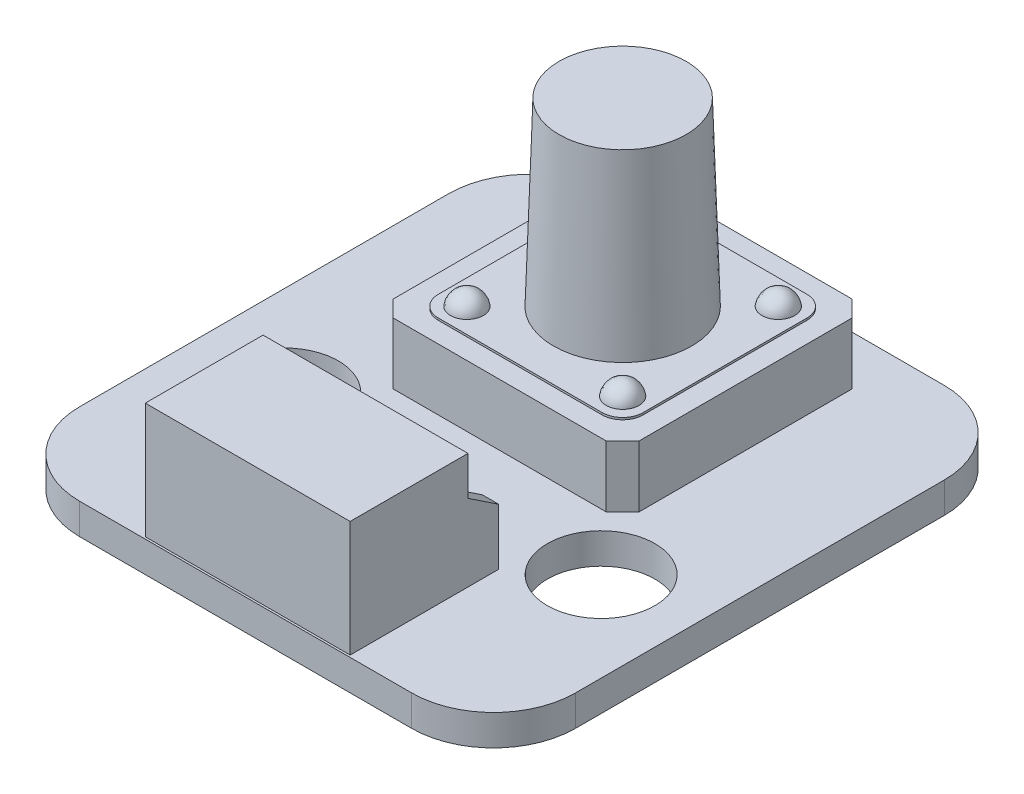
ISO-10303-21;
HEADER;
FILE_DESCRIPTION(('STEP AP214'),'2;1');
FILE_NAME('part.step','',(''),(''),'','','');
FILE_SCHEMA(('AUTOMOTIVE_DESIGN { 1 0 10303 214 1 1 1 1 }'));
ENDSEC;
DATA;
#1=APPLICATION_CONTEXT('core data for automotive mechanical design processes');
#2=APPLICATION_PROTOCOL_DEFINITION('international standard','automotive_design',2000,#1);
#3=PRODUCT_CONTEXT('',#1,'mechanical');
#4=PRODUCT('Part','Part','',(#3));
#5=PRODUCT_RELATED_PRODUCT_CATEGORY('part','',(#4));
#6=PRODUCT_DEFINITION_FORMATION('','',#4);
#7=PRODUCT_DEFINITION_CONTEXT('part definition',#1,'design');
#8=PRODUCT_DEFINITION('design','',#6,#7);
#9=PRODUCT_DEFINITION_SHAPE('','',#8);
#10=(LENGTH_UNIT() NAMED_UNIT(*) SI_UNIT(.MILLI.,.METRE.));
#11=(NAMED_UNIT(*) PLANE_ANGLE_UNIT() SI_UNIT($,.RADIAN.));
#12=(NAMED_UNIT(*) SI_UNIT($,.STERADIAN.) SOLID_ANGLE_UNIT());
#13=UNCERTAINTY_MEASURE_WITH_UNIT(LENGTH_MEASURE(1.E-05),#10,'distance_accuracy_value','');
#14=(GEOMETRIC_REPRESENTATION_CONTEXT(3) GLOBAL_UNCERTAINTY_ASSIGNED_CONTEXT((#13)) GLOBAL_UNIT_ASSIGNED_CONTEXT((#10,
#11,#12)) REPRESENTATION_CONTEXT('',''));
#15=CARTESIAN_POINT('',(0.,0.,0.));
#16=DIRECTION('',(0.,0.,1.));
#17=DIRECTION('',(1.,0.,0.));
#18=AXIS2_PLACEMENT_3D('',#15,#16,#17);
#19=CARTESIAN_POINT('',(15.9,4.50002458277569,-14.6062715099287));
#20=DIRECTION('',(-1.,0.,0.));
#21=DIRECTION('',(0.,0.,-1.));
#22=AXIS2_PLACEMENT_3D('',#19,#20,#21);
#23=CIRCLE('',#22,0.800000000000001);
#24=TRIMMED_CURVE('',#23,(PARAMETER_VALUE(-1.57863579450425)),
(PARAMETER_VALUE(1.57863579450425)),.T.,.PARAMETER.);
#25=CARTESIAN_POINT('',(15.9,4.50002458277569,-14.6));
#26=DIRECTION('',(0.,-1.,0.));
#27=AXIS1_PLACEMENT('',#25,#26);
#28=SURFACE_OF_REVOLUTION('',#24,#27);
#29=CARTESIAN_POINT('',(15.9,4.6,-14.6));
#30=DIRECTION('',(0.,-1.,0.));
#31=DIRECTION('',(0.,0.,-1.));
#32=AXIS2_PLACEMENT_3D('',#29,#30,#31);
#33=CIRCLE('',#32,0.8);
#34=CARTESIAN_POINT('',(15.9,4.6,-15.4));
#35=VERTEX_POINT('',#34);
#36=EDGE_CURVE('E45',#35,#35,#33,.T.);
#37=ORIENTED_EDGE('',*,*,#36,.F.);
#38=EDGE_LOOP('',(#37));
#39=FACE_BOUND('',#38,.T.);
#40=CARTESIAN_POINT('',(15.9,5.3,-14.6));
#41=VERTEX_POINT('',#40);
#42=VERTEX_LOOP('',#41);
#43=FACE_BOUND('',#42,.T.);
#44=ADVANCED_FACE('F38',(#39,#43),#28,.T.);
#45=CARTESIAN_POINT('',(8.3,4.50002458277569,-14.6062715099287));
#46=DIRECTION('',(-1.,0.,0.));
#47=DIRECTION('',(0.,0.,-1.));
#48=AXIS2_PLACEMENT_3D('',#45,#46,#47);
#49=CIRCLE('',#48,0.800000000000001);
#50=TRIMMED_CURVE('',#49,(PARAMETER_VALUE(-1.57863579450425)),
(PARAMETER_VALUE(1.57863579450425)),.T.,.PARAMETER.);
#51=CARTESIAN_POINT('',(8.3,4.50002458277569,-14.6));
#52=DIRECTION('',(0.,-1.,0.));
#53=AXIS1_PLACEMENT('',#51,#52);
#54=SURFACE_OF_REVOLUTION('',#50,#53);
#55=CARTESIAN_POINT('',(8.3,4.6,-14.6));
#56=DIRECTION('',(0.,-1.,0.));
#57=DIRECTION('',(0.,0.,-1.));
#58=AXIS2_PLACEMENT_3D('',#55,#56,#57);
#59=CIRCLE('',#58,0.8);
#60=CARTESIAN_POINT('',(8.3,4.6,-15.4));
#61=VERTEX_POINT('',#60);
#62=EDGE_CURVE('E398',#61,#61,#59,.T.);
#63=ORIENTED_EDGE('',*,*,#62,.F.);
#64=EDGE_LOOP('',(#63));
#65=FACE_BOUND('',#64,.T.);
#66=CARTESIAN_POINT('',(8.3,5.3,-14.6));
#67=VERTEX_POINT('',#66);
#68=VERTEX_LOOP('',#67);
#69=FACE_BOUND('',#68,.T.);
#70=ADVANCED_FACE('F388',(#65,#69),#54,.T.);
#71=CARTESIAN_POINT('',(15.9,4.50002458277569,-22.2062715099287));
#72=DIRECTION('',(-1.,0.,0.));
#73=DIRECTION('',(0.,0.,-1.));
#74=AXIS2_PLACEMENT_3D('',#71,#72,#73);
#75=CIRCLE('',#74,0.800000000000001);
#76=TRIMMED_CURVE('',#75,(PARAMETER_VALUE(-1.57863579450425)),
(PARAMETER_VALUE(1.57863579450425)),.T.,.PARAMETER.);
#77=CARTESIAN_POINT('',(15.9,4.50002458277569,-22.2));
#78=DIRECTION('',(0.,-1.,0.));
#79=AXIS1_PLACEMENT('',#77,#78);
#80=SURFACE_OF_REVOLUTION('',#76,#79);
#81=CARTESIAN_POINT('',(15.9,4.6,-22.2));
#82=DIRECTION('',(0.,-1.,0.));
#83=DIRECTION('',(0.,0.,-1.));
#84=AXIS2_PLACEMENT_3D('',#81,#82,#83);
#85=CIRCLE('',#84,0.8);
#86=CARTESIAN_POINT('',(15.9,4.6,-23.));
#87=VERTEX_POINT('',#86);
#88=EDGE_CURVE('E400',#87,#87,#85,.T.);
#89=ORIENTED_EDGE('',*,*,#88,.F.);
#90=EDGE_LOOP('',(#89));
#91=FACE_BOUND('',#90,.T.);
#92=CARTESIAN_POINT('',(15.9,5.3,-22.2));
#93=VERTEX_POINT('',#92);
#94=VERTEX_LOOP('',#93);
#95=FACE_BOUND('',#94,.T.);
#96=ADVANCED_FACE('F393',(#91,#95),#80,.T.);
#97=CARTESIAN_POINT('',(0.,4.5,0.));
#98=DIRECTION('',(0.,-1.,0.));
#99=DIRECTION('',(0.,0.,-1.));
#100=AXIS2_PLACEMENT_3D('',#97,#98,#99);
#101=PLANE('',#100);
#102=DIRECTION('',(-0.707106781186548,0.,0.707106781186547));
#103=VECTOR('',#102,1.);
#104=CARTESIAN_POINT('',(6.1,4.5,-23.6));
#105=LINE('',#104,#103);
#106=CARTESIAN_POINT('',(6.9,4.5,-24.4));
#107=VERTEX_POINT('',#106);
#108=CARTESIAN_POINT('',(6.1,4.5,-23.6));
#109=VERTEX_POINT('',#108);
#110=EDGE_CURVE('E702',#107,#109,#105,.T.);
#111=ORIENTED_EDGE('',*,*,#110,.T.);
#112=DIRECTION('',(0.,0.,1.));
#113=VECTOR('',#112,1.);
#114=CARTESIAN_POINT('',(6.1,4.5,-23.6));
#115=LINE('',#114,#113);
#116=CARTESIAN_POINT('',(6.1,4.5,-13.2));
#117=VERTEX_POINT('',#116);
#118=EDGE_CURVE('E731',#109,#117,#115,.T.);
#119=ORIENTED_EDGE('',*,*,#118,.T.);
#120=DIRECTION('',(0.707106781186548,0.,0.707106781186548));
#121=VECTOR('',#120,1.);
#122=CARTESIAN_POINT('',(6.1,4.5,-13.2));
#123=LINE('',#122,#121);
#124=CARTESIAN_POINT('',(6.9,4.5,-12.4));
#125=VERTEX_POINT('',#124);
#126=EDGE_CURVE('E729',#117,#125,#123,.T.);
#127=ORIENTED_EDGE('',*,*,#126,.T.);
#128=DIRECTION('',(1.,0.,0.));
#129=VECTOR('',#128,1.);
#130=CARTESIAN_POINT('',(6.9,4.5,-12.4));
#131=LINE('',#130,#129);
#132=CARTESIAN_POINT('',(17.3,4.5,-12.4));
#133=VERTEX_POINT('',#132);
#134=EDGE_CURVE('E727',#125,#133,#131,.T.);
#135=ORIENTED_EDGE('',*,*,#134,.T.);
#136=DIRECTION('',(0.707106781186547,0.,-0.707106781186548));
#137=VECTOR('',#136,1.);
#138=CARTESIAN_POINT('',(17.3,4.5,-12.4));
#139=LINE('',#138,#137);
#140=CARTESIAN_POINT('',(18.1,4.5,-13.2));
#141=VERTEX_POINT('',#140);
#142=EDGE_CURVE('E725',#133,#141,#139,.T.);
#143=ORIENTED_EDGE('',*,*,#142,.T.);
#144=DIRECTION('',(0.,0.,-1.));
#145=VECTOR('',#144,1.);
#146=CARTESIAN_POINT('',(18.1,4.5,-23.6));
#147=LINE('',#146,#145);
#148=CARTESIAN_POINT('',(18.1,4.5,-23.6));
#149=VERTEX_POINT('',#148);
#150=EDGE_CURVE('E723',#141,#149,#147,.T.);
#151=ORIENTED_EDGE('',*,*,#150,.T.);
#152=DIRECTION('',(-0.707106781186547,0.,-0.707106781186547));
#153=VECTOR('',#152,1.);
#154=CARTESIAN_POINT('',(17.3,4.5,-24.4));
#155=LINE('',#154,#153);
#156=CARTESIAN_POINT('',(17.3,4.5,-24.4));
#157=VERTEX_POINT('',#156);
#158=EDGE_CURVE('E721',#149,#157,#155,.T.);
#159=ORIENTED_EDGE('',*,*,#158,.T.);
#160=DIRECTION('',(-1.,0.,0.));
#161=VECTOR('',#160,1.);
#162=CARTESIAN_POINT('',(6.9,4.5,-24.4));
#163=LINE('',#162,#161);
#164=EDGE_CURVE('E699',#157,#107,#163,.T.);
#165=ORIENTED_EDGE('',*,*,#164,.T.);
#166=EDGE_LOOP('',(#111,#119,#127,#135,#143,#151,#159,#165));
#167=FACE_BOUND('',#166,.T.);
#168=CARTESIAN_POINT('',(8.1,4.5,-14.4));
#169=DIRECTION('',(0.,1.,0.));
#170=DIRECTION('',(0.,0.,1.));
#171=AXIS2_PLACEMENT_3D('',#168,#169,#170);
#172=CIRCLE('',#171,1.);
#173=CARTESIAN_POINT('',(7.1,4.5,-14.4));
#174=VERTEX_POINT('',#173);
#175=CARTESIAN_POINT('',(8.1,4.5,-13.4));
#176=VERTEX_POINT('',#175);
#177=EDGE_CURVE('E781',#174,#176,#172,.T.);
#178=ORIENTED_EDGE('',*,*,#177,.F.);
#179=DIRECTION('',(0.,0.,1.));
#180=VECTOR('',#179,1.);
#181=CARTESIAN_POINT('',(7.1,4.5,-22.4));
#182=LINE('',#181,#180);
#183=CARTESIAN_POINT('',(7.1,4.5,-22.4));
#184=VERTEX_POINT('',#183);
#185=EDGE_CURVE('E759',#184,#174,#182,.T.);
#186=ORIENTED_EDGE('',*,*,#185,.F.);
#187=CARTESIAN_POINT('',(8.1,4.5,-22.4));
#188=DIRECTION('',(0.,1.,0.));
#189=DIRECTION('',(0.,0.,1.));
#190=AXIS2_PLACEMENT_3D('',#187,#188,#189);
#191=CIRCLE('',#190,1.);
#192=CARTESIAN_POINT('',(8.1,4.5,-23.4));
#193=VERTEX_POINT('',#192);
#194=EDGE_CURVE('E763',#193,#184,#191,.T.);
#195=ORIENTED_EDGE('',*,*,#194,.F.);
#196=DIRECTION('',(-1.,0.,0.));
#197=VECTOR('',#196,1.);
#198=CARTESIAN_POINT('',(8.1,4.5,-23.4));
#199=LINE('',#198,#197);
#200=CARTESIAN_POINT('',(16.1,4.5,-23.4));
#201=VERTEX_POINT('',#200);
#202=EDGE_CURVE('E766',#201,#193,#199,.T.);
#203=ORIENTED_EDGE('',*,*,#202,.F.);
#204=CARTESIAN_POINT('',(16.1,4.5,-22.4));
#205=DIRECTION('',(0.,1.,0.));
#206=DIRECTION('',(0.,0.,-1.));
#207=AXIS2_PLACEMENT_3D('',#204,#205,#206);
#208=CIRCLE('',#207,1.);
#209=CARTESIAN_POINT('',(17.1,4.5,-22.4));
#210=VERTEX_POINT('',#209);
#211=EDGE_CURVE('E769',#210,#201,#208,.T.);
#212=ORIENTED_EDGE('',*,*,#211,.F.);
#213=DIRECTION('',(0.,0.,-1.));
#214=VECTOR('',#213,1.);
#215=CARTESIAN_POINT('',(17.1,4.5,-22.4));
#216=LINE('',#215,#214);
#217=CARTESIAN_POINT('',(17.1,4.5,-14.4));
#218=VERTEX_POINT('',#217);
#219=EDGE_CURVE('E772',#218,#210,#216,.T.);
#220=ORIENTED_EDGE('',*,*,#219,.F.);
#221=CARTESIAN_POINT('',(16.1,4.5,-14.4));
#222=DIRECTION('',(0.,1.,0.));
#223=DIRECTION('',(0.,0.,1.));
#224=AXIS2_PLACEMENT_3D('',#221,#222,#223);
#225=CIRCLE('',#224,1.);
#226=CARTESIAN_POINT('',(16.1,4.5,-13.4));
#227=VERTEX_POINT('',#226);
#228=EDGE_CURVE('E775',#227,#218,#225,.T.);
#229=ORIENTED_EDGE('',*,*,#228,.F.);
#230=DIRECTION('',(1.,0.,0.));
#231=VECTOR('',#230,1.);
#232=CARTESIAN_POINT('',(8.1,4.5,-13.4));
#233=LINE('',#232,#231);
#234=EDGE_CURVE('E778',#176,#227,#233,.T.);
#235=ORIENTED_EDGE('',*,*,#234,.F.);
#236=EDGE_LOOP('',(#178,#186,#195,#203,#212,#220,#229,#235));
#237=FACE_BOUND('',#236,.T.);
#238=ADVANCED_FACE('F834',(#167,#237),#101,.F.);
#239=CARTESIAN_POINT('',(0.,1.5,0.));
#240=DIRECTION('',(0.,1.,0.));
#241=DIRECTION('',(0.,0.,1.));
#242=AXIS2_PLACEMENT_3D('',#239,#240,#241);
#243=PLANE('',#242);
#244=DIRECTION('',(1.,0.,0.));
#245=VECTOR('',#244,1.);
#246=CARTESIAN_POINT('',(0.,1.5,0.));
#247=LINE('',#246,#245);
#248=CARTESIAN_POINT('',(4.00000000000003,1.5,0.));
#249=VERTEX_POINT('',#248);
#250=CARTESIAN_POINT('',(20.2,1.5,0.));
#251=VERTEX_POINT('',#250);
#252=EDGE_CURVE('E475',#249,#251,#247,.T.);
#253=ORIENTED_EDGE('',*,*,#252,.T.);
#254=CARTESIAN_POINT('',(20.2,1.5,-4.));
#255=DIRECTION('',(0.,1.,0.));
#256=DIRECTION('',(0.,0.,1.));
#257=AXIS2_PLACEMENT_3D('',#254,#255,#256);
#258=CIRCLE('',#257,4.);
#259=CARTESIAN_POINT('',(24.2,1.5,-4.00000000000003));
#260=VERTEX_POINT('',#259);
#261=EDGE_CURVE('E523',#251,#260,#258,.T.);
#262=ORIENTED_EDGE('',*,*,#261,.T.);
#263=DIRECTION('',(0.,0.,-1.));
#264=VECTOR('',#263,1.);
#265=CARTESIAN_POINT('',(24.2,1.5,0.));
#266=LINE('',#265,#264);
#267=CARTESIAN_POINT('',(24.2,1.5,-22.));
#268=VERTEX_POINT('',#267);
#269=EDGE_CURVE('E521',#260,#268,#266,.T.);
#270=ORIENTED_EDGE('',*,*,#269,.T.);
#271=CARTESIAN_POINT('',(20.2,1.5,-22.));
#272=DIRECTION('',(0.,1.,0.));
#273=DIRECTION('',(0.,0.,1.));
#274=AXIS2_PLACEMENT_3D('',#271,#272,#273);
#275=CIRCLE('',#274,4.);
#276=CARTESIAN_POINT('',(20.2,1.5,-26.));
#277=VERTEX_POINT('',#276);
#278=EDGE_CURVE('E519',#268,#277,#275,.T.);
#279=ORIENTED_EDGE('',*,*,#278,.T.);
#280=DIRECTION('',(1.,0.,0.));
#281=VECTOR('',#280,1.);
#282=CARTESIAN_POINT('',(0.,1.5,-26.));
#283=LINE('',#282,#281);
#284=CARTESIAN_POINT('',(4.00000000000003,1.5,-26.));
#285=VERTEX_POINT('',#284);
#286=EDGE_CURVE('E516',#285,#277,#283,.T.);
#287=ORIENTED_EDGE('',*,*,#286,.F.);
#288=CARTESIAN_POINT('',(4.,1.5,-22.));
#289=DIRECTION('',(0.,1.,0.));
#290=DIRECTION('',(0.,0.,1.));
#291=AXIS2_PLACEMENT_3D('',#288,#289,#290);
#292=CIRCLE('',#291,4.);
#293=CARTESIAN_POINT('',(0.,1.5,-22.));
#294=VERTEX_POINT('',#293);
#295=EDGE_CURVE('E513',#294,#285,#292,.F.);
#296=ORIENTED_EDGE('',*,*,#295,.F.);
#297=DIRECTION('',(0.,0.,-1.));
#298=VECTOR('',#297,1.);
#299=CARTESIAN_POINT('',(0.,1.5,0.));
#300=LINE('',#299,#298);
#301=CARTESIAN_POINT('',(0.,1.5,-4.00000000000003));
#302=VERTEX_POINT('',#301);
#303=EDGE_CURVE('E510',#302,#294,#300,.T.);
#304=ORIENTED_EDGE('',*,*,#303,.F.);
#305=CARTESIAN_POINT('',(4.,1.5,-4.));
#306=DIRECTION('',(0.,1.,0.));
#307=DIRECTION('',(0.,0.,1.));
#308=AXIS2_PLACEMENT_3D('',#305,#306,#307);
#309=CIRCLE('',#308,4.);
#310=EDGE_CURVE('E507',#249,#302,#309,.F.);
#311=ORIENTED_EDGE('',*,*,#310,.F.);
#312=EDGE_LOOP('',(#253,#262,#270,#279,#287,#296,#304,#311));
#313=FACE_BOUND('',#312,.T.);
#314=CARTESIAN_POINT('',(4.375,1.5,-9.625));
#315=DIRECTION('',(0.,1.,0.));
#316=DIRECTION('',(0.,0.,1.));
#317=AXIS2_PLACEMENT_3D('',#314,#315,#316);
#318=CIRCLE('',#317,2.625);
#319=CARTESIAN_POINT('',(4.375,1.5,-7.));
#320=VERTEX_POINT('',#319);
#321=EDGE_CURVE('E504',#320,#320,#318,.T.);
#322=ORIENTED_EDGE('',*,*,#321,.F.);
#323=EDGE_LOOP('',(#322));
#324=FACE_BOUND('',#323,.T.);
#325=CARTESIAN_POINT('',(19.825,1.5,-9.62500000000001));
#326=DIRECTION('',(0.,1.,0.));
#327=DIRECTION('',(0.,0.,1.));
#328=AXIS2_PLACEMENT_3D('',#325,#326,#327);
#329=CIRCLE('',#328,2.625);
#330=CARTESIAN_POINT('',(19.825,1.5,-7.00000000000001));
#331=VERTEX_POINT('',#330);
#332=EDGE_CURVE('E471',#331,#331,#329,.F.);
#333=ORIENTED_EDGE('',*,*,#332,.T.);
#334=EDGE_LOOP('',(#333));
#335=FACE_BOUND('',#334,.T.);
#336=DIRECTION('',(-1.,0.,0.));
#337=VECTOR('',#336,1.);
#338=CARTESIAN_POINT('',(10.3,1.5,-8.35));
#339=LINE('',#338,#337);
#340=CARTESIAN_POINT('',(10.3,1.5,-8.35));
#341=VERTEX_POINT('',#340);
#342=CARTESIAN_POINT('',(9.8,1.5,-8.35));
#343=VERTEX_POINT('',#342);
#344=EDGE_CURVE('E671',#341,#343,#339,.T.);
#345=ORIENTED_EDGE('',*,*,#344,.F.);
#346=DIRECTION('',(0.,0.,1.));
#347=VECTOR('',#346,1.);
#348=CARTESIAN_POINT('',(10.3,1.5,-6.35));
#349=LINE('',#348,#347);
#350=CARTESIAN_POINT('',(10.3,1.5,-5.85));
#351=VERTEX_POINT('',#350);
#352=EDGE_CURVE('E614',#341,#351,#349,.T.);
#353=ORIENTED_EDGE('',*,*,#352,.T.);
#354=DIRECTION('',(-1.,0.,0.));
#355=VECTOR('',#354,1.);
#356=CARTESIAN_POINT('',(7.9,1.5,-5.85));
#357=LINE('',#356,#355);
#358=CARTESIAN_POINT('',(11.85,1.5,-5.85));
#359=VERTEX_POINT('',#358);
#360=EDGE_CURVE('E580',#359,#351,#357,.T.);
#361=ORIENTED_EDGE('',*,*,#360,.F.);
#362=DIRECTION('',(0.,0.,1.));
#363=VECTOR('',#362,1.);
#364=CARTESIAN_POINT('',(11.85,1.5,-6.35));
#365=LINE('',#364,#363);
#366=CARTESIAN_POINT('',(11.85,1.5,-8.35));
#367=VERTEX_POINT('',#366);
#368=EDGE_CURVE('E633',#367,#359,#365,.T.);
#369=ORIENTED_EDGE('',*,*,#368,.F.);
#370=DIRECTION('',(-1.,0.,0.));
#371=VECTOR('',#370,1.);
#372=CARTESIAN_POINT('',(12.35,1.5,-8.35));
#373=LINE('',#372,#371);
#374=CARTESIAN_POINT('',(12.35,1.5,-8.35));
#375=VERTEX_POINT('',#374);
#376=EDGE_CURVE('E661',#375,#367,#373,.T.);
#377=ORIENTED_EDGE('',*,*,#376,.F.);
#378=DIRECTION('',(0.,0.,1.));
#379=VECTOR('',#378,1.);
#380=CARTESIAN_POINT('',(12.35,1.5,-6.35));
#381=LINE('',#380,#379);
#382=CARTESIAN_POINT('',(12.35,1.5,-5.85));
#383=VERTEX_POINT('',#382);
#384=EDGE_CURVE('E627',#375,#383,#381,.T.);
#385=ORIENTED_EDGE('',*,*,#384,.T.);
#386=CARTESIAN_POINT('',(13.9,1.5,-5.85));
#387=VERTEX_POINT('',#386);
#388=EDGE_CURVE('E579',#387,#383,#357,.T.);
#389=ORIENTED_EDGE('',*,*,#388,.F.);
#390=DIRECTION('',(0.,0.,1.));
#391=VECTOR('',#390,1.);
#392=CARTESIAN_POINT('',(13.9,1.5,-6.35));
#393=LINE('',#392,#391);
#394=CARTESIAN_POINT('',(13.9,1.5,-8.35));
#395=VERTEX_POINT('',#394);
#396=EDGE_CURVE('E598',#395,#387,#393,.T.);
#397=ORIENTED_EDGE('',*,*,#396,.F.);
#398=DIRECTION('',(-1.,0.,0.));
#399=VECTOR('',#398,1.);
#400=CARTESIAN_POINT('',(14.4,1.5,-8.35));
#401=LINE('',#400,#399);
#402=CARTESIAN_POINT('',(14.4,1.5,-8.35));
#403=VERTEX_POINT('',#402);
#404=EDGE_CURVE('E651',#403,#395,#401,.T.);
#405=ORIENTED_EDGE('',*,*,#404,.F.);
#406=DIRECTION('',(0.,0.,1.));
#407=VECTOR('',#406,1.);
#408=CARTESIAN_POINT('',(14.4,1.5,-6.35));
#409=LINE('',#408,#407);
#410=CARTESIAN_POINT('',(14.4,1.5,-5.85));
#411=VERTEX_POINT('',#410);
#412=EDGE_CURVE('E584',#403,#411,#409,.T.);
#413=ORIENTED_EDGE('',*,*,#412,.T.);
#414=CARTESIAN_POINT('',(16.3,1.5,-5.85));
#415=VERTEX_POINT('',#414);
#416=EDGE_CURVE('E573',#415,#411,#357,.T.);
#417=ORIENTED_EDGE('',*,*,#416,.F.);
#418=DIRECTION('',(0.,0.,1.));
#419=VECTOR('',#418,1.);
#420=CARTESIAN_POINT('',(16.3,1.5,-7.35));
#421=LINE('',#420,#419);
#422=CARTESIAN_POINT('',(16.3,1.5,-7.35));
#423=VERTEX_POINT('',#422);
#424=EDGE_CURVE('E591',#423,#415,#421,.T.);
#425=ORIENTED_EDGE('',*,*,#424,.F.);
#426=DIRECTION('',(-1.,0.,0.));
#427=VECTOR('',#426,1.);
#428=CARTESIAN_POINT('',(7.1,1.5,-7.35));
#429=LINE('',#428,#427);
#430=CARTESIAN_POINT('',(17.1,1.5,-7.35));
#431=VERTEX_POINT('',#430);
#432=EDGE_CURVE('E531',#431,#423,#429,.T.);
#433=ORIENTED_EDGE('',*,*,#432,.F.);
#434=DIRECTION('',(0.,0.,-1.));
#435=VECTOR('',#434,1.);
#436=CARTESIAN_POINT('',(17.1,1.5,-7.35));
#437=LINE('',#436,#435);
#438=CARTESIAN_POINT('',(17.1,1.5,-0.1));
#439=VERTEX_POINT('',#438);
#440=EDGE_CURVE('E536',#439,#431,#437,.T.);
#441=ORIENTED_EDGE('',*,*,#440,.F.);
#442=DIRECTION('',(1.,0.,0.));
#443=VECTOR('',#442,1.);
#444=CARTESIAN_POINT('',(7.1,1.5,-0.1));
#445=LINE('',#444,#443);
#446=CARTESIAN_POINT('',(7.1,1.5,-0.1));
#447=VERTEX_POINT('',#446);
#448=EDGE_CURVE('E550',#447,#439,#445,.T.);
#449=ORIENTED_EDGE('',*,*,#448,.F.);
#450=DIRECTION('',(0.,0.,1.));
#451=VECTOR('',#450,1.);
#452=CARTESIAN_POINT('',(7.1,1.5,-7.35));
#453=LINE('',#452,#451);
#454=CARTESIAN_POINT('',(7.1,1.5,-7.35));
#455=VERTEX_POINT('',#454);
#456=EDGE_CURVE('E539',#455,#447,#453,.T.);
#457=ORIENTED_EDGE('',*,*,#456,.F.);
#458=CARTESIAN_POINT('',(7.9,1.5,-7.35));
#459=VERTEX_POINT('',#458);
#460=EDGE_CURVE('E535',#459,#455,#429,.T.);
#461=ORIENTED_EDGE('',*,*,#460,.F.);
#462=DIRECTION('',(0.,0.,-1.));
#463=VECTOR('',#462,1.);
#464=CARTESIAN_POINT('',(7.9,1.5,-7.35));
#465=LINE('',#464,#463);
#466=CARTESIAN_POINT('',(7.9,1.5,-5.85));
#467=VERTEX_POINT('',#466);
#468=EDGE_CURVE('E592',#467,#459,#465,.T.);
#469=ORIENTED_EDGE('',*,*,#468,.F.);
#470=CARTESIAN_POINT('',(9.8,1.5,-5.85));
#471=VERTEX_POINT('',#470);
#472=EDGE_CURVE('E594',#471,#467,#357,.T.);
#473=ORIENTED_EDGE('',*,*,#472,.F.);
#474=DIRECTION('',(0.,0.,1.));
#475=VECTOR('',#474,1.);
#476=CARTESIAN_POINT('',(9.8,1.5,-6.35));
#477=LINE('',#476,#475);
#478=EDGE_CURVE('E609',#343,#471,#477,.T.);
#479=ORIENTED_EDGE('',*,*,#478,.F.);
#480=EDGE_LOOP('',(#345,#353,#361,#369,#377,#385,#389,#397,#405,#413,#417,#425,#433,#441,#449,
#457,#461,#469,#473,#479));
#481=FACE_BOUND('',#480,.T.);
#482=DIRECTION('',(0.,0.,1.));
#483=VECTOR('',#482,1.);
#484=CARTESIAN_POINT('',(6.1,1.5,-23.6));
#485=LINE('',#484,#483);
#486=CARTESIAN_POINT('',(6.1,1.5,-23.6));
#487=VERTEX_POINT('',#486);
#488=CARTESIAN_POINT('',(6.1,1.5,-13.2));
#489=VERTEX_POINT('',#488);
#490=EDGE_CURVE('E714',#487,#489,#485,.T.);
#491=ORIENTED_EDGE('',*,*,#490,.F.);
#492=DIRECTION('',(-0.707106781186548,0.,0.707106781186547));
#493=VECTOR('',#492,1.);
#494=CARTESIAN_POINT('',(6.1,1.5,-23.6));
#495=LINE('',#494,#493);
#496=CARTESIAN_POINT('',(6.9,1.5,-24.4));
#497=VERTEX_POINT('',#496);
#498=EDGE_CURVE('E716',#497,#487,#495,.T.);
#499=ORIENTED_EDGE('',*,*,#498,.F.);
#500=DIRECTION('',(-1.,0.,0.));
#501=VECTOR('',#500,1.);
#502=CARTESIAN_POINT('',(6.9,1.5,-24.4));
#503=LINE('',#502,#501);
#504=CARTESIAN_POINT('',(17.3,1.5,-24.4));
#505=VERTEX_POINT('',#504);
#506=EDGE_CURVE('E700',#505,#497,#503,.T.);
#507=ORIENTED_EDGE('',*,*,#506,.F.);
#508=DIRECTION('',(-0.707106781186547,0.,-0.707106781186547));
#509=VECTOR('',#508,1.);
#510=CARTESIAN_POINT('',(17.3,1.5,-24.4));
#511=LINE('',#510,#509);
#512=CARTESIAN_POINT('',(18.1,1.5,-23.6));
#513=VERTEX_POINT('',#512);
#514=EDGE_CURVE('E703',#513,#505,#511,.T.);
#515=ORIENTED_EDGE('',*,*,#514,.F.);
#516=DIRECTION('',(0.,0.,-1.));
#517=VECTOR('',#516,1.);
#518=CARTESIAN_POINT('',(18.1,1.5,-23.6));
#519=LINE('',#518,#517);
#520=CARTESIAN_POINT('',(18.1,1.5,-13.2));
#521=VERTEX_POINT('',#520);
#522=EDGE_CURVE('E706',#521,#513,#519,.T.);
#523=ORIENTED_EDGE('',*,*,#522,.F.);
#524=DIRECTION('',(0.707106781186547,0.,-0.707106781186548));
#525=VECTOR('',#524,1.);
#526=CARTESIAN_POINT('',(17.3,1.5,-12.4));
#527=LINE('',#526,#525);
#528=CARTESIAN_POINT('',(17.3,1.5,-12.4));
#529=VERTEX_POINT('',#528);
#530=EDGE_CURVE('E708',#529,#521,#527,.T.);
#531=ORIENTED_EDGE('',*,*,#530,.F.);
#532=DIRECTION('',(1.,0.,0.));
#533=VECTOR('',#532,1.);
#534=CARTESIAN_POINT('',(6.9,1.5,-12.4));
#535=LINE('',#534,#533);
#536=CARTESIAN_POINT('',(6.9,1.5,-12.4));
#537=VERTEX_POINT('',#536);
#538=EDGE_CURVE('E710',#537,#529,#535,.T.);
#539=ORIENTED_EDGE('',*,*,#538,.F.);
#540=DIRECTION('',(0.707106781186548,0.,0.707106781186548));
#541=VECTOR('',#540,1.);
#542=CARTESIAN_POINT('',(6.1,1.5,-13.2));
#543=LINE('',#542,#541);
#544=EDGE_CURVE('E712',#489,#537,#543,.T.);
#545=ORIENTED_EDGE('',*,*,#544,.F.);
#546=EDGE_LOOP('',(#491,#499,#507,#515,#523,#531,#539,#545));
#547=FACE_BOUND('',#546,.T.);
#548=ADVANCED_FACE('F942',(#313,#324,#335,#481,#547),#243,.T.);
#549=CARTESIAN_POINT('',(0.,0.,-6.35));
#550=DIRECTION('',(0.,0.,1.));
#551=DIRECTION('',(1.,0.,0.));
#552=AXIS2_PLACEMENT_3D('',#549,#550,#551);
#553=PLANE('',#552);
#554=DIRECTION('',(1.,0.,0.));
#555=VECTOR('',#554,1.);
#556=CARTESIAN_POINT('',(10.3,2.,-6.35));
#557=LINE('',#556,#555);
#558=CARTESIAN_POINT('',(9.8,2.,-6.35));
#559=VERTEX_POINT('',#558);
#560=CARTESIAN_POINT('',(10.3,2.,-6.35));
#561=VERTEX_POINT('',#560);
#562=EDGE_CURVE('E672',#559,#561,#557,.T.);
#563=ORIENTED_EDGE('',*,*,#562,.F.);
#564=DIRECTION('',(0.,1.,0.));
#565=VECTOR('',#564,1.);
#566=CARTESIAN_POINT('',(9.8,4.28425473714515,-6.35));
#567=LINE('',#566,#565);
#568=CARTESIAN_POINT('',(9.8,3.78425473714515,-6.35));
#569=VERTEX_POINT('',#568);
#570=EDGE_CURVE('E621',#559,#569,#567,.T.);
#571=ORIENTED_EDGE('',*,*,#570,.T.);
#572=DIRECTION('',(1.,0.,0.));
#573=VECTOR('',#572,1.);
#574=CARTESIAN_POINT('',(0.,3.78425473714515,-6.35));
#575=LINE('',#574,#573);
#576=CARTESIAN_POINT('',(10.3,3.78425473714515,-6.35));
#577=VERTEX_POINT('',#576);
#578=EDGE_CURVE('E444',#569,#577,#575,.T.);
#579=ORIENTED_EDGE('',*,*,#578,.T.);
#580=DIRECTION('',(0.,-1.,0.));
#581=VECTOR('',#580,1.);
#582=CARTESIAN_POINT('',(10.3,4.28425473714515,-6.35));
#583=LINE('',#582,#581);
#584=EDGE_CURVE('E617',#577,#561,#583,.T.);
#585=ORIENTED_EDGE('',*,*,#584,.T.);
#586=EDGE_LOOP('',(#563,#571,#579,#585));
#587=FACE_BOUND('',#586,.T.);
#588=ADVANCED_FACE('F1032',(#587),#553,.F.);
#589=CARTESIAN_POINT('',(0.,0.,-6.35));
#590=DIRECTION('',(0.,0.,1.));
#591=DIRECTION('',(1.,0.,0.));
#592=AXIS2_PLACEMENT_3D('',#589,#590,#591);
#593=PLANE('',#592);
#594=DIRECTION('',(1.,0.,0.));
#595=VECTOR('',#594,1.);
#596=CARTESIAN_POINT('',(12.35,2.,-6.35));
#597=LINE('',#596,#595);
#598=CARTESIAN_POINT('',(11.85,2.,-6.35));
#599=VERTEX_POINT('',#598);
#600=CARTESIAN_POINT('',(12.35,2.,-6.35));
#601=VERTEX_POINT('',#600);
#602=EDGE_CURVE('E662',#599,#601,#597,.T.);
#603=ORIENTED_EDGE('',*,*,#602,.F.);
#604=DIRECTION('',(0.,1.,0.));
#605=VECTOR('',#604,1.);
#606=CARTESIAN_POINT('',(11.85,4.28425473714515,-6.35));
#607=LINE('',#606,#605);
#608=CARTESIAN_POINT('',(11.85,3.78425473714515,-6.35));
#609=VERTEX_POINT('',#608);
#610=EDGE_CURVE('E635',#599,#609,#607,.T.);
#611=ORIENTED_EDGE('',*,*,#610,.T.);
#612=DIRECTION('',(1.,0.,0.));
#613=VECTOR('',#612,1.);
#614=CARTESIAN_POINT('',(0.,3.78425473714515,-6.35));
#615=LINE('',#614,#613);
#616=CARTESIAN_POINT('',(12.35,3.78425473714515,-6.35));
#617=VERTEX_POINT('',#616);
#618=EDGE_CURVE('E436',#609,#617,#615,.T.);
#619=ORIENTED_EDGE('',*,*,#618,.T.);
#620=DIRECTION('',(0.,-1.,0.));
#621=VECTOR('',#620,1.);
#622=CARTESIAN_POINT('',(12.35,4.28425473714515,-6.35));
#623=LINE('',#622,#621);
#624=EDGE_CURVE('E638',#617,#601,#623,.T.);
#625=ORIENTED_EDGE('',*,*,#624,.T.);
#626=EDGE_LOOP('',(#603,#611,#619,#625));
#627=FACE_BOUND('',#626,.T.);
#628=ADVANCED_FACE('F1178',(#627),#593,.F.);
#629=CARTESIAN_POINT('',(0.,0.,-6.35));
#630=DIRECTION('',(0.,0.,-1.));
#631=DIRECTION('',(-1.,0.,0.));
#632=AXIS2_PLACEMENT_3D('',#629,#630,#631);
#633=PLANE('',#632);
#634=DIRECTION('',(0.,-1.,0.));
#635=VECTOR('',#634,1.);
#636=CARTESIAN_POINT('',(14.4,4.28425473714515,-6.35));
#637=LINE('',#636,#635);
#638=CARTESIAN_POINT('',(14.4,3.78425473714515,-6.35));
#639=VERTEX_POINT('',#638);
#640=CARTESIAN_POINT('',(14.4,2.,-6.35));
#641=VERTEX_POINT('',#640);
#642=EDGE_CURVE('E604',#639,#641,#637,.T.);
#643=ORIENTED_EDGE('',*,*,#642,.T.);
#644=DIRECTION('',(1.,0.,0.));
#645=VECTOR('',#644,1.);
#646=CARTESIAN_POINT('',(14.4,2.,-6.35));
#647=LINE('',#646,#645);
#648=CARTESIAN_POINT('',(13.9,2.,-6.35));
#649=VERTEX_POINT('',#648);
#650=EDGE_CURVE('E652',#649,#641,#647,.T.);
#651=ORIENTED_EDGE('',*,*,#650,.F.);
#652=DIRECTION('',(0.,1.,0.));
#653=VECTOR('',#652,1.);
#654=CARTESIAN_POINT('',(13.9,4.28425473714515,-6.35));
#655=LINE('',#654,#653);
#656=CARTESIAN_POINT('',(13.9,3.78425473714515,-6.35));
#657=VERTEX_POINT('',#656);
#658=EDGE_CURVE('E600',#649,#657,#655,.T.);
#659=ORIENTED_EDGE('',*,*,#658,.T.);
#660=DIRECTION('',(1.,0.,0.));
#661=VECTOR('',#660,1.);
#662=CARTESIAN_POINT('',(14.4,3.78425473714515,-6.35));
#663=LINE('',#662,#661);
#664=EDGE_CURVE('E428',#657,#639,#663,.T.);
#665=ORIENTED_EDGE('',*,*,#664,.T.);
#666=EDGE_LOOP('',(#643,#651,#659,#665));
#667=FACE_BOUND('',#666,.T.);
#668=ADVANCED_FACE('F1172',(#667),#633,.T.);
#669=CARTESIAN_POINT('',(17.1,0.,-5.85));
#670=DIRECTION('',(0.,0.,-1.));
#671=DIRECTION('',(-1.,0.,0.));
#672=AXIS2_PLACEMENT_3D('',#669,#670,#671);
#673=PLANE('',#672);
#674=ORIENTED_EDGE('',*,*,#388,.T.);
#675=DIRECTION('',(0.,-1.,0.));
#676=VECTOR('',#675,1.);
#677=CARTESIAN_POINT('',(12.35,4.28425473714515,-5.85));
#678=LINE('',#677,#676);
#679=CARTESIAN_POINT('',(12.35,4.28425473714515,-5.85));
#680=VERTEX_POINT('',#679);
#681=EDGE_CURVE('E639',#680,#383,#678,.T.);
#682=ORIENTED_EDGE('',*,*,#681,.F.);
#683=DIRECTION('',(1.,0.,0.));
#684=VECTOR('',#683,1.);
#685=CARTESIAN_POINT('',(12.35,4.28425473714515,-5.85));
#686=LINE('',#685,#684);
#687=CARTESIAN_POINT('',(11.85,4.28425473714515,-5.85));
#688=VERTEX_POINT('',#687);
#689=EDGE_CURVE('E641',#688,#680,#686,.T.);
#690=ORIENTED_EDGE('',*,*,#689,.F.);
#691=DIRECTION('',(0.,1.,0.));
#692=VECTOR('',#691,1.);
#693=CARTESIAN_POINT('',(11.85,4.28425473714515,-5.85));
#694=LINE('',#693,#692);
#695=EDGE_CURVE('E636',#359,#688,#694,.T.);
#696=ORIENTED_EDGE('',*,*,#695,.F.);
#697=ORIENTED_EDGE('',*,*,#360,.T.);
#698=DIRECTION('',(0.,-1.,0.));
#699=VECTOR('',#698,1.);
#700=CARTESIAN_POINT('',(10.3,4.28425473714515,-5.85));
#701=LINE('',#700,#699);
#702=CARTESIAN_POINT('',(10.3,4.28425473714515,-5.85));
#703=VERTEX_POINT('',#702);
#704=EDGE_CURVE('E618',#703,#351,#701,.T.);
#705=ORIENTED_EDGE('',*,*,#704,.F.);
#706=DIRECTION('',(1.,0.,0.));
#707=VECTOR('',#706,1.);
#708=CARTESIAN_POINT('',(10.3,4.28425473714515,-5.85));
#709=LINE('',#708,#707);
#710=CARTESIAN_POINT('',(9.8,4.28425473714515,-5.85));
#711=VERTEX_POINT('',#710);
#712=EDGE_CURVE('E622',#711,#703,#709,.T.);
#713=ORIENTED_EDGE('',*,*,#712,.F.);
#714=DIRECTION('',(0.,1.,0.));
#715=VECTOR('',#714,1.);
#716=CARTESIAN_POINT('',(9.8,4.28425473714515,-5.85));
#717=LINE('',#716,#715);
#718=EDGE_CURVE('E625',#471,#711,#717,.T.);
#719=ORIENTED_EDGE('',*,*,#718,.F.);
#720=ORIENTED_EDGE('',*,*,#472,.T.);
#721=DIRECTION('',(0.,1.,0.));
#722=VECTOR('',#721,1.);
#723=CARTESIAN_POINT('',(7.9,-7.03287759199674,-5.85));
#724=LINE('',#723,#722);
#725=CARTESIAN_POINT('',(7.9,5.25,-5.85));
#726=VERTEX_POINT('',#725);
#727=EDGE_CURVE('E581',#467,#726,#724,.T.);
#728=ORIENTED_EDGE('',*,*,#727,.T.);
#729=DIRECTION('',(-1.,0.,0.));
#730=VECTOR('',#729,1.);
#731=CARTESIAN_POINT('',(17.1,5.25,-5.85));
#732=LINE('',#731,#730);
#733=CARTESIAN_POINT('',(7.1,5.25,-5.85));
#734=VERTEX_POINT('',#733);
#735=EDGE_CURVE('E560',#726,#734,#732,.T.);
#736=ORIENTED_EDGE('',*,*,#735,.T.);
#737=DIRECTION('',(0.,-1.,0.));
#738=VECTOR('',#737,1.);
#739=CARTESIAN_POINT('',(7.1,0.,-5.85));
#740=LINE('',#739,#738);
#741=CARTESIAN_POINT('',(7.1,7.15,-5.85));
#742=VERTEX_POINT('',#741);
#743=EDGE_CURVE('E566',#742,#734,#740,.T.);
#744=ORIENTED_EDGE('',*,*,#743,.F.);
#745=DIRECTION('',(-1.,0.,0.));
#746=VECTOR('',#745,1.);
#747=CARTESIAN_POINT('',(17.1,7.15,-5.85));
#748=LINE('',#747,#746);
#749=CARTESIAN_POINT('',(17.1,7.15,-5.85));
#750=VERTEX_POINT('',#749);
#751=EDGE_CURVE('E559',#750,#742,#748,.T.);
#752=ORIENTED_EDGE('',*,*,#751,.F.);
#753=DIRECTION('',(0.,-1.,0.));
#754=VECTOR('',#753,1.);
#755=CARTESIAN_POINT('',(17.1,0.,-5.85));
#756=LINE('',#755,#754);
#757=CARTESIAN_POINT('',(17.1,5.25,-5.85));
#758=VERTEX_POINT('',#757);
#759=EDGE_CURVE('E574',#750,#758,#756,.T.);
#760=ORIENTED_EDGE('',*,*,#759,.T.);
#761=CARTESIAN_POINT('',(16.3,5.25,-5.85));
#762=VERTEX_POINT('',#761);
#763=EDGE_CURVE('E556',#758,#762,#732,.T.);
#764=ORIENTED_EDGE('',*,*,#763,.T.);
#765=DIRECTION('',(0.,1.,0.));
#766=VECTOR('',#765,1.);
#767=CARTESIAN_POINT('',(16.3,-7.03287759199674,-5.85));
#768=LINE('',#767,#766);
#769=EDGE_CURVE('E583',#415,#762,#768,.T.);
#770=ORIENTED_EDGE('',*,*,#769,.F.);
#771=ORIENTED_EDGE('',*,*,#416,.T.);
#772=DIRECTION('',(0.,-1.,0.));
#773=VECTOR('',#772,1.);
#774=CARTESIAN_POINT('',(14.4,4.28425473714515,-5.85));
#775=LINE('',#774,#773);
#776=CARTESIAN_POINT('',(14.4,4.28425473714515,-5.85));
#777=VERTEX_POINT('',#776);
#778=EDGE_CURVE('E607',#777,#411,#775,.T.);
#779=ORIENTED_EDGE('',*,*,#778,.F.);
#780=DIRECTION('',(1.,0.,0.));
#781=VECTOR('',#780,1.);
#782=CARTESIAN_POINT('',(14.4,4.28425473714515,-5.85));
#783=LINE('',#782,#781);
#784=CARTESIAN_POINT('',(13.9,4.28425473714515,-5.85));
#785=VERTEX_POINT('',#784);
#786=EDGE_CURVE('E601',#785,#777,#783,.T.);
#787=ORIENTED_EDGE('',*,*,#786,.F.);
#788=DIRECTION('',(0.,1.,0.));
#789=VECTOR('',#788,1.);
#790=CARTESIAN_POINT('',(13.9,4.28425473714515,-5.85));
#791=LINE('',#790,#789);
#792=EDGE_CURVE('E605',#387,#785,#791,.T.);
#793=ORIENTED_EDGE('',*,*,#792,.F.);
#794=EDGE_LOOP('',(#674,#682,#690,#696,#697,#705,#713,#719,#720,#728,#736,#744,#752,#760,#764,
#770,#771,#779,#787,#793));
#795=FACE_BOUND('',#794,.T.);
#796=ADVANCED_FACE('F1177',(#795),#673,.T.);
#797=CARTESIAN_POINT('',(7.1,7.15,-7.35));
#798=DIRECTION('',(0.,0.,1.));
#799=DIRECTION('',(1.,0.,0.));
#800=AXIS2_PLACEMENT_3D('',#797,#798,#799);
#801=PLANE('',#800);
#802=DIRECTION('',(-1.,0.,0.));
#803=VECTOR('',#802,1.);
#804=CARTESIAN_POINT('',(17.1,4.25,-7.35));
#805=LINE('',#804,#803);
#806=CARTESIAN_POINT('',(7.9,4.25,-7.35));
#807=VERTEX_POINT('',#806);
#808=CARTESIAN_POINT('',(7.1,4.25,-7.35));
#809=VERTEX_POINT('',#808);
#810=EDGE_CURVE('E563',#807,#809,#805,.T.);
#811=ORIENTED_EDGE('',*,*,#810,.F.);
#812=DIRECTION('',(0.,1.,0.));
#813=VECTOR('',#812,1.);
#814=CARTESIAN_POINT('',(7.9,-7.03287759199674,-7.35));
#815=LINE('',#814,#813);
#816=EDGE_CURVE('E589',#459,#807,#815,.T.);
#817=ORIENTED_EDGE('',*,*,#816,.F.);
#818=ORIENTED_EDGE('',*,*,#460,.T.);
#819=DIRECTION('',(0.,-1.,0.));
#820=VECTOR('',#819,1.);
#821=CARTESIAN_POINT('',(7.1,7.15,-7.35));
#822=LINE('',#821,#820);
#823=EDGE_CURVE('E527',#809,#455,#822,.T.);
#824=ORIENTED_EDGE('',*,*,#823,.F.);
#825=EDGE_LOOP('',(#811,#817,#818,#824));
#826=FACE_BOUND('',#825,.T.);
#827=ADVANCED_FACE('F1230',(#826),#801,.F.);
#828=CARTESIAN_POINT('',(17.1,6.33461538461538,-4.22307692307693));
#829=DIRECTION('',(0.,0.832050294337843,-0.554700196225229));
#830=DIRECTION('',(0.,0.554700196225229,0.832050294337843));
#831=AXIS2_PLACEMENT_3D('',#828,#829,#830);
#832=PLANE('',#831);
#833=DIRECTION('',(0.,0.554700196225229,0.832050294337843));
#834=VECTOR('',#833,1.);
#835=CARTESIAN_POINT('',(7.9,6.33461538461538,-4.22307692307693));
#836=LINE('',#835,#834);
#837=EDGE_CURVE('E447',#807,#726,#836,.T.);
#838=ORIENTED_EDGE('',*,*,#837,.F.);
#839=ORIENTED_EDGE('',*,*,#810,.T.);
#840=DIRECTION('',(0.,-0.554700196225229,-0.832050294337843));
#841=VECTOR('',#840,1.);
#842=CARTESIAN_POINT('',(7.1,6.33461538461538,-4.22307692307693));
#843=LINE('',#842,#841);
#844=EDGE_CURVE('E570',#734,#809,#843,.T.);
#845=ORIENTED_EDGE('',*,*,#844,.F.);
#846=ORIENTED_EDGE('',*,*,#735,.F.);
#847=EDGE_LOOP('',(#838,#839,#845,#846));
#848=FACE_BOUND('',#847,.T.);
#849=ADVANCED_FACE('F1265',(#848),#832,.T.);
#850=CARTESIAN_POINT('',(7.1,7.15,-7.35));
#851=DIRECTION('',(1.,0.,0.));
#852=DIRECTION('',(0.,0.,-1.));
#853=AXIS2_PLACEMENT_3D('',#850,#851,#852);
#854=PLANE('',#853);
#855=ORIENTED_EDGE('',*,*,#844,.T.);
#856=ORIENTED_EDGE('',*,*,#823,.T.);
#857=ORIENTED_EDGE('',*,*,#456,.T.);
#858=DIRECTION('',(0.,-1.,0.));
#859=VECTOR('',#858,1.);
#860=CARTESIAN_POINT('',(7.1,7.15,-0.1));
#861=LINE('',#860,#859);
#862=CARTESIAN_POINT('',(7.1,7.15,-0.1));
#863=VERTEX_POINT('',#862);
#864=EDGE_CURVE('E552',#863,#447,#861,.T.);
#865=ORIENTED_EDGE('',*,*,#864,.F.);
#866=DIRECTION('',(0.,0.,1.));
#867=VECTOR('',#866,1.);
#868=CARTESIAN_POINT('',(7.1,7.15,-7.35));
#869=LINE('',#868,#867);
#870=EDGE_CURVE('E534',#742,#863,#869,.T.);
#871=ORIENTED_EDGE('',*,*,#870,.F.);
#872=ORIENTED_EDGE('',*,*,#743,.T.);
#873=EDGE_LOOP('',(#855,#856,#857,#865,#871,#872));
#874=FACE_BOUND('',#873,.T.);
#875=ADVANCED_FACE('F1291',(#874),#854,.F.);
#876=CARTESIAN_POINT('',(17.1,7.15,-7.35));
#877=DIRECTION('',(-1.,0.,0.));
#878=DIRECTION('',(0.,0.,1.));
#879=AXIS2_PLACEMENT_3D('',#876,#877,#878);
#880=PLANE('',#879);
#881=DIRECTION('',(0.,-0.554700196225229,-0.832050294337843));
#882=VECTOR('',#881,1.);
#883=CARTESIAN_POINT('',(17.1,6.33461538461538,-4.22307692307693));
#884=LINE('',#883,#882);
#885=CARTESIAN_POINT('',(17.1,4.25,-7.35));
#886=VERTEX_POINT('',#885);
#887=EDGE_CURVE('E569',#758,#886,#884,.T.);
#888=ORIENTED_EDGE('',*,*,#887,.F.);
#889=ORIENTED_EDGE('',*,*,#759,.F.);
#890=DIRECTION('',(0.,0.,-1.));
#891=VECTOR('',#890,1.);
#892=CARTESIAN_POINT('',(17.1,7.15,-7.35));
#893=LINE('',#892,#891);
#894=CARTESIAN_POINT('',(17.1,7.15,-0.1));
#895=VERTEX_POINT('',#894);
#896=EDGE_CURVE('E530',#895,#750,#893,.T.);
#897=ORIENTED_EDGE('',*,*,#896,.F.);
#898=DIRECTION('',(0.,1.,0.));
#899=VECTOR('',#898,1.);
#900=CARTESIAN_POINT('',(17.1,7.15,-0.1));
#901=LINE('',#900,#899);
#902=EDGE_CURVE('E548',#439,#895,#901,.T.);
#903=ORIENTED_EDGE('',*,*,#902,.F.);
#904=ORIENTED_EDGE('',*,*,#440,.T.);
#905=DIRECTION('',(0.,-1.,0.));
#906=VECTOR('',#905,1.);
#907=CARTESIAN_POINT('',(17.1,7.15,-7.35));
#908=LINE('',#907,#906);
#909=EDGE_CURVE('E501',#886,#431,#908,.T.);
#910=ORIENTED_EDGE('',*,*,#909,.F.);
#911=EDGE_LOOP('',(#888,#889,#897,#903,#904,#910));
#912=FACE_BOUND('',#911,.T.);
#913=ADVANCED_FACE('F1305',(#912),#880,.F.);
#914=CARTESIAN_POINT('',(0.,7.15,0.));
#915=DIRECTION('',(0.,1.,0.));
#916=DIRECTION('',(0.,0.,1.));
#917=AXIS2_PLACEMENT_3D('',#914,#915,#916);
#918=PLANE('',#917);
#919=ORIENTED_EDGE('',*,*,#896,.T.);
#920=ORIENTED_EDGE('',*,*,#751,.T.);
#921=ORIENTED_EDGE('',*,*,#870,.T.);
#922=DIRECTION('',(-1.,0.,0.));
#923=VECTOR('',#922,1.);
#924=CARTESIAN_POINT('',(7.1,7.15,-0.1));
#925=LINE('',#924,#923);
#926=EDGE_CURVE('E542',#895,#863,#925,.T.);
#927=ORIENTED_EDGE('',*,*,#926,.F.);
#928=EDGE_LOOP('',(#919,#920,#921,#927));
#929=FACE_BOUND('',#928,.T.);
#930=ADVANCED_FACE('F1278',(#929),#918,.T.);
#931=ORIENTED_EDGE('',*,*,#432,.T.);
#932=DIRECTION('',(0.,1.,0.));
#933=VECTOR('',#932,1.);
#934=CARTESIAN_POINT('',(16.3,-7.03287759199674,-7.35));
#935=LINE('',#934,#933);
#936=CARTESIAN_POINT('',(16.3,4.25,-7.35));
#937=VERTEX_POINT('',#936);
#938=EDGE_CURVE('E586',#423,#937,#935,.T.);
#939=ORIENTED_EDGE('',*,*,#938,.T.);
#940=EDGE_CURVE('E555',#886,#937,#805,.T.);
#941=ORIENTED_EDGE('',*,*,#940,.F.);
#942=ORIENTED_EDGE('',*,*,#909,.T.);
#943=EDGE_LOOP('',(#931,#939,#941,#942));
#944=FACE_BOUND('',#943,.T.);
#945=ADVANCED_FACE('F1272',(#944),#801,.F.);
#946=CARTESIAN_POINT('',(0.,1.5,0.));
#947=DIRECTION('',(0.,0.,-1.));
#948=DIRECTION('',(-1.,0.,0.));
#949=AXIS2_PLACEMENT_3D('',#946,#947,#948);
#950=PLANE('',#949);
#951=DIRECTION('',(0.,-1.,0.));
#952=VECTOR('',#951,1.);
#953=CARTESIAN_POINT('',(20.2,1.5,0.));
#954=LINE('',#953,#952);
#955=CARTESIAN_POINT('',(20.2,0.,0.));
#956=VERTEX_POINT('',#955);
#957=EDGE_CURVE('E452',#251,#956,#954,.T.);
#958=ORIENTED_EDGE('',*,*,#957,.F.);
#959=ORIENTED_EDGE('',*,*,#252,.F.);
#960=DIRECTION('',(0.,-1.,0.));
#961=VECTOR('',#960,1.);
#962=CARTESIAN_POINT('',(4.00000000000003,1.5,0.));
#963=LINE('',#962,#961);
#964=CARTESIAN_POINT('',(4.00000000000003,0.,0.));
#965=VERTEX_POINT('',#964);
#966=EDGE_CURVE('E469',#249,#965,#963,.T.);
#967=ORIENTED_EDGE('',*,*,#966,.T.);
#968=DIRECTION('',(1.,0.,0.));
#969=VECTOR('',#968,1.);
#970=CARTESIAN_POINT('',(0.,0.,0.));
#971=LINE('',#970,#969);
#972=EDGE_CURVE('E498',#965,#956,#971,.T.);
#973=ORIENTED_EDGE('',*,*,#972,.T.);
#974=EDGE_LOOP('',(#958,#959,#967,#973));
#975=FACE_BOUND('',#974,.T.);
#976=ADVANCED_FACE('F1277',(#975),#950,.F.);
#977=CARTESIAN_POINT('',(20.2,1.5,-4.));
#978=DIRECTION('',(0.,-1.,0.));
#979=DIRECTION('',(0.,0.,-1.));
#980=AXIS2_PLACEMENT_3D('',#977,#978,#979);
#981=CYLINDRICAL_SURFACE('',#980,4.);
#982=CARTESIAN_POINT('',(20.2,0.,-4.));
#983=DIRECTION('',(0.,1.,0.));
#984=DIRECTION('',(0.,0.,1.));
#985=AXIS2_PLACEMENT_3D('',#982,#983,#984);
#986=CIRCLE('',#985,4.);
#987=CARTESIAN_POINT('',(24.2,0.,-4.00000000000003));
#988=VERTEX_POINT('',#987);
#989=EDGE_CURVE('E496',#956,#988,#986,.T.);
#990=ORIENTED_EDGE('',*,*,#989,.T.);
#991=DIRECTION('',(0.,-1.,0.));
#992=VECTOR('',#991,1.);
#993=CARTESIAN_POINT('',(24.2,1.5,-4.00000000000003));
#994=LINE('',#993,#992);
#995=EDGE_CURVE('E455',#260,#988,#994,.T.);
#996=ORIENTED_EDGE('',*,*,#995,.F.);
#997=ORIENTED_EDGE('',*,*,#261,.F.);
#998=ORIENTED_EDGE('',*,*,#957,.T.);
#999=EDGE_LOOP('',(#990,#996,#997,#998));
#1000=FACE_BOUND('',#999,.T.);
#1001=ADVANCED_FACE('F1339',(#1000),#981,.T.);
#1002=CARTESIAN_POINT('',(24.2,1.5,0.));
#1003=DIRECTION('',(-1.,0.,0.));
#1004=DIRECTION('',(0.,0.,1.));
#1005=AXIS2_PLACEMENT_3D('',#1002,#1003,#1004);
#1006=PLANE('',#1005);
#1007=DIRECTION('',(0.,0.,-1.));
#1008=VECTOR('',#1007,1.);
#1009=CARTESIAN_POINT('',(24.2,0.,0.));
#1010=LINE('',#1009,#1008);
#1011=CARTESIAN_POINT('',(24.2,0.,-22.));
#1012=VERTEX_POINT('',#1011);
#1013=EDGE_CURVE('E494',#988,#1012,#1010,.T.);
#1014=ORIENTED_EDGE('',*,*,#1013,.T.);
#1015=DIRECTION('',(0.,-1.,0.));
#1016=VECTOR('',#1015,1.);
#1017=CARTESIAN_POINT('',(24.2,1.5,-22.));
#1018=LINE('',#1017,#1016);
#1019=EDGE_CURVE('E458',#268,#1012,#1018,.T.);
#1020=ORIENTED_EDGE('',*,*,#1019,.F.);
#1021=ORIENTED_EDGE('',*,*,#269,.F.);
#1022=ORIENTED_EDGE('',*,*,#995,.T.);
#1023=EDGE_LOOP('',(#1014,#1020,#1021,#1022));
#1024=FACE_BOUND('',#1023,.T.);
#1025=ADVANCED_FACE('F1421',(#1024),#1006,.F.);
#1026=CARTESIAN_POINT('',(20.2,1.5,-22.));
#1027=DIRECTION('',(0.,-1.,0.));
#1028=DIRECTION('',(0.,0.,-1.));
#1029=AXIS2_PLACEMENT_3D('',#1026,#1027,#1028);
#1030=CYLINDRICAL_SURFACE('',#1029,4.);
#1031=CARTESIAN_POINT('',(20.2,0.,-22.));
#1032=DIRECTION('',(0.,1.,0.));
#1033=DIRECTION('',(0.,0.,1.));
#1034=AXIS2_PLACEMENT_3D('',#1031,#1032,#1033);
#1035=CIRCLE('',#1034,4.);
#1036=CARTESIAN_POINT('',(20.2,0.,-26.));
#1037=VERTEX_POINT('',#1036);
#1038=EDGE_CURVE('E491',#1012,#1037,#1035,.T.);
#1039=ORIENTED_EDGE('',*,*,#1038,.T.);
#1040=DIRECTION('',(0.,-1.,0.));
#1041=VECTOR('',#1040,1.);
#1042=CARTESIAN_POINT('',(20.2,1.5,-26.));
#1043=LINE('',#1042,#1041);
#1044=EDGE_CURVE('E461',#277,#1037,#1043,.T.);
#1045=ORIENTED_EDGE('',*,*,#1044,.F.);
#1046=ORIENTED_EDGE('',*,*,#278,.F.);
#1047=ORIENTED_EDGE('',*,*,#1019,.T.);
#1048=EDGE_LOOP('',(#1039,#1045,#1046,#1047));
#1049=FACE_BOUND('',#1048,.T.);
#1050=ADVANCED_FACE('F1411',(#1049),#1030,.T.);
#1051=CARTESIAN_POINT('',(0.,1.5,-26.));
#1052=DIRECTION('',(0.,0.,-1.));
#1053=DIRECTION('',(-1.,0.,0.));
#1054=AXIS2_PLACEMENT_3D('',#1051,#1052,#1053);
#1055=PLANE('',#1054);
#1056=DIRECTION('',(1.,0.,0.));
#1057=VECTOR('',#1056,1.);
#1058=CARTESIAN_POINT('',(0.,0.,-26.));
#1059=LINE('',#1058,#1057);
#1060=CARTESIAN_POINT('',(4.00000000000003,0.,-26.));
#1061=VERTEX_POINT('',#1060);
#1062=EDGE_CURVE('E488',#1061,#1037,#1059,.T.);
#1063=ORIENTED_EDGE('',*,*,#1062,.F.);
#1064=DIRECTION('',(0.,-1.,0.));
#1065=VECTOR('',#1064,1.);
#1066=CARTESIAN_POINT('',(4.00000000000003,1.5,-26.));
#1067=LINE('',#1066,#1065);
#1068=EDGE_CURVE('E463',#285,#1061,#1067,.T.);
#1069=ORIENTED_EDGE('',*,*,#1068,.F.);
#1070=ORIENTED_EDGE('',*,*,#286,.T.);
#1071=ORIENTED_EDGE('',*,*,#1044,.T.);
#1072=EDGE_LOOP('',(#1063,#1069,#1070,#1071));
#1073=FACE_BOUND('',#1072,.T.);
#1074=ADVANCED_FACE('F1401',(#1073),#1055,.T.);
#1075=CARTESIAN_POINT('',(4.,1.5,-22.));
#1076=DIRECTION('',(0.,-1.,0.));
#1077=DIRECTION('',(0.,0.,-1.));
#1078=AXIS2_PLACEMENT_3D('',#1075,#1076,#1077);
#1079=CYLINDRICAL_SURFACE('',#1078,4.);
#1080=CARTESIAN_POINT('',(4.,0.,-22.));
#1081=DIRECTION('',(0.,1.,0.));
#1082=DIRECTION('',(0.,0.,1.));
#1083=AXIS2_PLACEMENT_3D('',#1080,#1081,#1082);
#1084=CIRCLE('',#1083,4.);
#1085=CARTESIAN_POINT('',(0.,0.,-22.));
#1086=VERTEX_POINT('',#1085);
#1087=EDGE_CURVE('E485',#1086,#1061,#1084,.F.);
#1088=ORIENTED_EDGE('',*,*,#1087,.F.);
#1089=DIRECTION('',(0.,-1.,0.));
#1090=VECTOR('',#1089,1.);
#1091=CARTESIAN_POINT('',(0.,1.5,-22.));
#1092=LINE('',#1091,#1090);
#1093=EDGE_CURVE('E465',#294,#1086,#1092,.T.);
#1094=ORIENTED_EDGE('',*,*,#1093,.F.);
#1095=ORIENTED_EDGE('',*,*,#295,.T.);
#1096=ORIENTED_EDGE('',*,*,#1068,.T.);
#1097=EDGE_LOOP('',(#1088,#1094,#1095,#1096));
#1098=FACE_BOUND('',#1097,.T.);
#1099=ADVANCED_FACE('F1391',(#1098),#1079,.T.);
#1100=CARTESIAN_POINT('',(0.,1.5,0.));
#1101=DIRECTION('',(-1.,0.,0.));
#1102=DIRECTION('',(0.,0.,1.));
#1103=AXIS2_PLACEMENT_3D('',#1100,#1101,#1102);
#1104=PLANE('',#1103);
#1105=DIRECTION('',(0.,0.,-1.));
#1106=VECTOR('',#1105,1.);
#1107=CARTESIAN_POINT('',(0.,0.,0.));
#1108=LINE('',#1107,#1106);
#1109=CARTESIAN_POINT('',(0.,0.,-4.00000000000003));
#1110=VERTEX_POINT('',#1109);
#1111=EDGE_CURVE('E482',#1110,#1086,#1108,.T.);
#1112=ORIENTED_EDGE('',*,*,#1111,.F.);
#1113=DIRECTION('',(0.,-1.,0.));
#1114=VECTOR('',#1113,1.);
#1115=CARTESIAN_POINT('',(0.,1.5,-4.00000000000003));
#1116=LINE('',#1115,#1114);
#1117=EDGE_CURVE('E467',#302,#1110,#1116,.T.);
#1118=ORIENTED_EDGE('',*,*,#1117,.F.);
#1119=ORIENTED_EDGE('',*,*,#303,.T.);
#1120=ORIENTED_EDGE('',*,*,#1093,.T.);
#1121=EDGE_LOOP('',(#1112,#1118,#1119,#1120));
#1122=FACE_BOUND('',#1121,.T.);
#1123=ADVANCED_FACE('F1381',(#1122),#1104,.T.);
#1124=CARTESIAN_POINT('',(4.375,1.5,-9.625));
#1125=DIRECTION('',(0.,-1.,0.));
#1126=DIRECTION('',(0.,0.,-1.));
#1127=AXIS2_PLACEMENT_3D('',#1124,#1125,#1126);
#1128=CYLINDRICAL_SURFACE('',#1127,2.625);
#1129=ORIENTED_EDGE('',*,*,#321,.T.);
#1130=EDGE_LOOP('',(#1129));
#1131=FACE_BOUND('',#1130,.T.);
#1132=CARTESIAN_POINT('',(4.375,0.,-9.625));
#1133=DIRECTION('',(0.,1.,0.));
#1134=DIRECTION('',(0.,0.,1.));
#1135=AXIS2_PLACEMENT_3D('',#1132,#1133,#1134);
#1136=CIRCLE('',#1135,2.625);
#1137=CARTESIAN_POINT('',(4.375,0.,-7.));
#1138=VERTEX_POINT('',#1137);
#1139=EDGE_CURVE('E476',#1138,#1138,#1136,.T.);
#1140=ORIENTED_EDGE('',*,*,#1139,.F.);
#1141=EDGE_LOOP('',(#1140));
#1142=FACE_BOUND('',#1141,.T.);
#1143=ADVANCED_FACE('F1371',(#1131,#1142),#1128,.F.);
#1144=CARTESIAN_POINT('',(4.,1.5,-4.));
#1145=DIRECTION('',(0.,-1.,0.));
#1146=DIRECTION('',(0.,0.,-1.));
#1147=AXIS2_PLACEMENT_3D('',#1144,#1145,#1146);
#1148=CYLINDRICAL_SURFACE('',#1147,4.);
#1149=CARTESIAN_POINT('',(4.,0.,-4.));
#1150=DIRECTION('',(0.,1.,0.));
#1151=DIRECTION('',(0.,0.,1.));
#1152=AXIS2_PLACEMENT_3D('',#1149,#1150,#1151);
#1153=CIRCLE('',#1152,4.);
#1154=EDGE_CURVE('E479',#965,#1110,#1153,.F.);
#1155=ORIENTED_EDGE('',*,*,#1154,.F.);
#1156=ORIENTED_EDGE('',*,*,#966,.F.);
#1157=ORIENTED_EDGE('',*,*,#310,.T.);
#1158=ORIENTED_EDGE('',*,*,#1117,.T.);
#1159=EDGE_LOOP('',(#1155,#1156,#1157,#1158));
#1160=FACE_BOUND('',#1159,.T.);
#1161=ADVANCED_FACE('F1361',(#1160),#1148,.T.);
#1162=CARTESIAN_POINT('',(19.825,1.5,-9.62500000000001));
#1163=DIRECTION('',(0.,-1.,0.));
#1164=DIRECTION('',(0.,0.,-1.));
#1165=AXIS2_PLACEMENT_3D('',#1162,#1163,#1164);
#1166=CYLINDRICAL_SURFACE('',#1165,2.625);
#1167=ORIENTED_EDGE('',*,*,#332,.F.);
#1168=EDGE_LOOP('',(#1167));
#1169=FACE_BOUND('',#1168,.T.);
#1170=CARTESIAN_POINT('',(19.825,0.,-9.62500000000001));
#1171=DIRECTION('',(0.,1.,0.));
#1172=DIRECTION('',(0.,0.,1.));
#1173=AXIS2_PLACEMENT_3D('',#1170,#1171,#1172);
#1174=CIRCLE('',#1173,2.625);
#1175=CARTESIAN_POINT('',(19.825,0.,-7.00000000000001));
#1176=VERTEX_POINT('',#1175);
#1177=EDGE_CURVE('E472',#1176,#1176,#1174,.F.);
#1178=ORIENTED_EDGE('',*,*,#1177,.T.);
#1179=EDGE_LOOP('',(#1178));
#1180=FACE_BOUND('',#1179,.T.);
#1181=ADVANCED_FACE('F1350',(#1169,#1180),#1166,.F.);
#1182=CARTESIAN_POINT('',(0.,0.,0.));
#1183=DIRECTION('',(0.,1.,0.));
#1184=DIRECTION('',(0.,0.,1.));
#1185=AXIS2_PLACEMENT_3D('',#1182,#1183,#1184);
#1186=PLANE('',#1185);
#1187=ORIENTED_EDGE('',*,*,#972,.F.);
#1188=ORIENTED_EDGE('',*,*,#1154,.T.);
#1189=ORIENTED_EDGE('',*,*,#1111,.T.);
#1190=ORIENTED_EDGE('',*,*,#1087,.T.);
#1191=ORIENTED_EDGE('',*,*,#1062,.T.);
#1192=ORIENTED_EDGE('',*,*,#1038,.F.);
#1193=ORIENTED_EDGE('',*,*,#1013,.F.);
#1194=ORIENTED_EDGE('',*,*,#989,.F.);
#1195=EDGE_LOOP('',(#1187,#1188,#1189,#1190,#1191,#1192,#1193,#1194));
#1196=FACE_BOUND('',#1195,.T.);
#1197=ORIENTED_EDGE('',*,*,#1139,.T.);
#1198=EDGE_LOOP('',(#1197));
#1199=FACE_BOUND('',#1198,.T.);
#1200=ORIENTED_EDGE('',*,*,#1177,.F.);
#1201=EDGE_LOOP('',(#1200));
#1202=FACE_BOUND('',#1201,.T.);
#1203=ADVANCED_FACE('F1329',(#1196,#1199,#1202),#1186,.F.);
#1204=CARTESIAN_POINT('',(0.,0.,-0.1));
#1205=DIRECTION('',(0.,0.,1.));
#1206=DIRECTION('',(1.,0.,0.));
#1207=AXIS2_PLACEMENT_3D('',#1204,#1205,#1206);
#1208=PLANE('',#1207);
#1209=ORIENTED_EDGE('',*,*,#864,.T.);
#1210=ORIENTED_EDGE('',*,*,#448,.T.);
#1211=ORIENTED_EDGE('',*,*,#902,.T.);
#1212=ORIENTED_EDGE('',*,*,#926,.T.);
#1213=EDGE_LOOP('',(#1209,#1210,#1211,#1212));
#1214=FACE_BOUND('',#1213,.T.);
#1215=ADVANCED_FACE('F1262',(#1214),#1208,.T.);
#1216=DIRECTION('',(0.,-0.554700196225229,-0.832050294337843));
#1217=VECTOR('',#1216,1.);
#1218=CARTESIAN_POINT('',(16.3,6.33461538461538,-4.22307692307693));
#1219=LINE('',#1218,#1217);
#1220=EDGE_CURVE('E450',#762,#937,#1219,.T.);
#1221=ORIENTED_EDGE('',*,*,#1220,.F.);
#1222=ORIENTED_EDGE('',*,*,#763,.F.);
#1223=ORIENTED_EDGE('',*,*,#887,.T.);
#1224=ORIENTED_EDGE('',*,*,#940,.T.);
#1225=EDGE_LOOP('',(#1221,#1222,#1223,#1224));
#1226=FACE_BOUND('',#1225,.T.);
#1227=ADVANCED_FACE('F1251',(#1226),#832,.T.);
#1228=CARTESIAN_POINT('',(7.9,-7.03287759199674,-7.35));
#1229=DIRECTION('',(-1.,0.,0.));
#1230=DIRECTION('',(0.,0.,1.));
#1231=AXIS2_PLACEMENT_3D('',#1228,#1229,#1230);
#1232=PLANE('',#1231);
#1233=ORIENTED_EDGE('',*,*,#837,.T.);
#1234=ORIENTED_EDGE('',*,*,#727,.F.);
#1235=ORIENTED_EDGE('',*,*,#468,.T.);
#1236=ORIENTED_EDGE('',*,*,#816,.T.);
#1237=EDGE_LOOP('',(#1233,#1234,#1235,#1236));
#1238=FACE_BOUND('',#1237,.T.);
#1239=ADVANCED_FACE('F1241',(#1238),#1232,.F.);
#1240=CARTESIAN_POINT('',(16.3,-7.03287759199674,-7.35));
#1241=DIRECTION('',(1.,0.,0.));
#1242=DIRECTION('',(0.,0.,-1.));
#1243=AXIS2_PLACEMENT_3D('',#1240,#1241,#1242);
#1244=PLANE('',#1243);
#1245=ORIENTED_EDGE('',*,*,#1220,.T.);
#1246=ORIENTED_EDGE('',*,*,#938,.F.);
#1247=ORIENTED_EDGE('',*,*,#424,.T.);
#1248=ORIENTED_EDGE('',*,*,#769,.T.);
#1249=EDGE_LOOP('',(#1245,#1246,#1247,#1248));
#1250=FACE_BOUND('',#1249,.T.);
#1251=ADVANCED_FACE('F1163',(#1250),#1244,.F.);
#1252=CARTESIAN_POINT('',(14.4,4.28425473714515,-6.35));
#1253=DIRECTION('',(-1.,0.,0.));
#1254=DIRECTION('',(0.,-1.,0.));
#1255=AXIS2_PLACEMENT_3D('',#1252,#1253,#1254);
#1256=PLANE('',#1255);
#1257=ORIENTED_EDGE('',*,*,#412,.F.);
#1258=CARTESIAN_POINT('',(14.4,1.5,-7.85));
#1259=DIRECTION('',(-1.,0.,0.));
#1260=DIRECTION('',(0.,-1.,0.));
#1261=AXIS2_PLACEMENT_3D('',#1258,#1259,#1260);
#1262=CIRCLE('',#1261,0.5);
#1263=CARTESIAN_POINT('',(14.4,2.,-7.85));
#1264=VERTEX_POINT('',#1263);
#1265=EDGE_CURVE('E409',#403,#1264,#1262,.F.);
#1266=ORIENTED_EDGE('',*,*,#1265,.T.);
#1267=DIRECTION('',(0.,0.,1.));
#1268=VECTOR('',#1267,1.);
#1269=CARTESIAN_POINT('',(14.4,2.,-8.35));
#1270=LINE('',#1269,#1268);
#1271=EDGE_CURVE('E649',#1264,#641,#1270,.T.);
#1272=ORIENTED_EDGE('',*,*,#1271,.T.);
#1273=ORIENTED_EDGE('',*,*,#642,.F.);
#1274=CARTESIAN_POINT('',(14.4,3.78425473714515,-5.85));
#1275=DIRECTION('',(-1.,0.,0.));
#1276=DIRECTION('',(0.,-1.,0.));
#1277=AXIS2_PLACEMENT_3D('',#1274,#1275,#1276);
#1278=CIRCLE('',#1277,0.5);
#1279=EDGE_CURVE('E426',#639,#777,#1278,.F.);
#1280=ORIENTED_EDGE('',*,*,#1279,.T.);
#1281=ORIENTED_EDGE('',*,*,#778,.T.);
#1282=EDGE_LOOP('',(#1257,#1266,#1272,#1273,#1280,#1281));
#1283=FACE_BOUND('',#1282,.T.);
#1284=ADVANCED_FACE('F1152',(#1283),#1256,.F.);
#1285=CARTESIAN_POINT('',(13.9,4.28425473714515,-6.35));
#1286=DIRECTION('',(1.,0.,0.));
#1287=DIRECTION('',(0.,0.,-1.));
#1288=AXIS2_PLACEMENT_3D('',#1285,#1286,#1287);
#1289=PLANE('',#1288);
#1290=DIRECTION('',(0.,0.,1.));
#1291=VECTOR('',#1290,1.);
#1292=CARTESIAN_POINT('',(13.9,2.,-8.35));
#1293=LINE('',#1292,#1291);
#1294=CARTESIAN_POINT('',(13.9,2.,-7.85));
#1295=VERTEX_POINT('',#1294);
#1296=EDGE_CURVE('E644',#1295,#649,#1293,.T.);
#1297=ORIENTED_EDGE('',*,*,#1296,.F.);
#1298=CARTESIAN_POINT('',(13.9,1.5,-7.85));
#1299=DIRECTION('',(1.,0.,0.));
#1300=DIRECTION('',(0.,0.,-1.));
#1301=AXIS2_PLACEMENT_3D('',#1298,#1299,#1300);
#1302=CIRCLE('',#1301,0.5);
#1303=EDGE_CURVE('E405',#1295,#395,#1302,.F.);
#1304=ORIENTED_EDGE('',*,*,#1303,.T.);
#1305=ORIENTED_EDGE('',*,*,#396,.T.);
#1306=ORIENTED_EDGE('',*,*,#792,.T.);
#1307=CARTESIAN_POINT('',(13.9,3.78425473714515,-5.85));
#1308=DIRECTION('',(1.,0.,0.));
#1309=DIRECTION('',(0.,0.,-1.));
#1310=AXIS2_PLACEMENT_3D('',#1307,#1308,#1309);
#1311=CIRCLE('',#1310,0.5);
#1312=EDGE_CURVE('E423',#785,#657,#1311,.F.);
#1313=ORIENTED_EDGE('',*,*,#1312,.T.);
#1314=ORIENTED_EDGE('',*,*,#658,.F.);
#1315=EDGE_LOOP('',(#1297,#1304,#1305,#1306,#1313,#1314));
#1316=FACE_BOUND('',#1315,.T.);
#1317=ADVANCED_FACE('F1141',(#1316),#1289,.F.);
#1318=CARTESIAN_POINT('',(9.8,4.28425473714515,-6.35));
#1319=DIRECTION('',(1.,0.,0.));
#1320=DIRECTION('',(0.,0.,-1.));
#1321=AXIS2_PLACEMENT_3D('',#1318,#1319,#1320);
#1322=PLANE('',#1321);
#1323=DIRECTION('',(0.,0.,1.));
#1324=VECTOR('',#1323,1.);
#1325=CARTESIAN_POINT('',(9.8,2.,-8.35));
#1326=LINE('',#1325,#1324);
#1327=CARTESIAN_POINT('',(9.8,2.,-7.85));
#1328=VERTEX_POINT('',#1327);
#1329=EDGE_CURVE('E665',#1328,#559,#1326,.T.);
#1330=ORIENTED_EDGE('',*,*,#1329,.F.);
#1331=CARTESIAN_POINT('',(9.8,1.5,-7.85));
#1332=DIRECTION('',(1.,0.,0.));
#1333=DIRECTION('',(0.,0.,-1.));
#1334=AXIS2_PLACEMENT_3D('',#1331,#1332,#1333);
#1335=CIRCLE('',#1334,0.5);
#1336=EDGE_CURVE('E417',#1328,#343,#1335,.F.);
#1337=ORIENTED_EDGE('',*,*,#1336,.T.);
#1338=ORIENTED_EDGE('',*,*,#478,.T.);
#1339=ORIENTED_EDGE('',*,*,#718,.T.);
#1340=CARTESIAN_POINT('',(9.8,3.78425473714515,-5.85));
#1341=DIRECTION('',(1.,0.,0.));
#1342=DIRECTION('',(0.,0.,-1.));
#1343=AXIS2_PLACEMENT_3D('',#1340,#1341,#1342);
#1344=CIRCLE('',#1343,0.5);
#1345=EDGE_CURVE('E439',#711,#569,#1344,.F.);
#1346=ORIENTED_EDGE('',*,*,#1345,.T.);
#1347=ORIENTED_EDGE('',*,*,#570,.F.);
#1348=EDGE_LOOP('',(#1330,#1337,#1338,#1339,#1346,#1347));
#1349=FACE_BOUND('',#1348,.T.);
#1350=ADVANCED_FACE('F1130',(#1349),#1322,.F.);
#1351=CARTESIAN_POINT('',(10.3,4.28425473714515,-6.35));
#1352=DIRECTION('',(-1.,0.,0.));
#1353=DIRECTION('',(0.,-1.,0.));
#1354=AXIS2_PLACEMENT_3D('',#1351,#1352,#1353);
#1355=PLANE('',#1354);
#1356=ORIENTED_EDGE('',*,*,#352,.F.);
#1357=CARTESIAN_POINT('',(10.3,1.5,-7.85));
#1358=DIRECTION('',(-1.,0.,0.));
#1359=DIRECTION('',(0.,-1.,0.));
#1360=AXIS2_PLACEMENT_3D('',#1357,#1358,#1359);
#1361=CIRCLE('',#1360,0.5);
#1362=CARTESIAN_POINT('',(10.3,2.,-7.85));
#1363=VERTEX_POINT('',#1362);
#1364=EDGE_CURVE('E421',#341,#1363,#1361,.F.);
#1365=ORIENTED_EDGE('',*,*,#1364,.T.);
#1366=DIRECTION('',(0.,0.,1.));
#1367=VECTOR('',#1366,1.);
#1368=CARTESIAN_POINT('',(10.3,2.,-8.35));
#1369=LINE('',#1368,#1367);
#1370=EDGE_CURVE('E669',#1363,#561,#1369,.T.);
#1371=ORIENTED_EDGE('',*,*,#1370,.T.);
#1372=ORIENTED_EDGE('',*,*,#584,.F.);
#1373=CARTESIAN_POINT('',(10.3,3.78425473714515,-5.85));
#1374=DIRECTION('',(-1.,0.,0.));
#1375=DIRECTION('',(0.,-1.,0.));
#1376=AXIS2_PLACEMENT_3D('',#1373,#1374,#1375);
#1377=CIRCLE('',#1376,0.5);
#1378=EDGE_CURVE('E442',#577,#703,#1377,.F.);
#1379=ORIENTED_EDGE('',*,*,#1378,.T.);
#1380=ORIENTED_EDGE('',*,*,#704,.T.);
#1381=EDGE_LOOP('',(#1356,#1365,#1371,#1372,#1379,#1380));
#1382=FACE_BOUND('',#1381,.T.);
#1383=ADVANCED_FACE('F1119',(#1382),#1355,.F.);
#1384=CARTESIAN_POINT('',(12.35,4.28425473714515,-6.35));
#1385=DIRECTION('',(-1.,0.,0.));
#1386=DIRECTION('',(0.,0.,1.));
#1387=AXIS2_PLACEMENT_3D('',#1384,#1385,#1386);
#1388=PLANE('',#1387);
#1389=ORIENTED_EDGE('',*,*,#384,.F.);
#1390=CARTESIAN_POINT('',(12.35,1.5,-7.85));
#1391=DIRECTION('',(-1.,0.,0.));
#1392=DIRECTION('',(0.,0.,1.));
#1393=AXIS2_PLACEMENT_3D('',#1390,#1391,#1392);
#1394=CIRCLE('',#1393,0.5);
#1395=CARTESIAN_POINT('',(12.35,2.,-7.85));
#1396=VERTEX_POINT('',#1395);
#1397=EDGE_CURVE('E415',#375,#1396,#1394,.F.);
#1398=ORIENTED_EDGE('',*,*,#1397,.T.);
#1399=DIRECTION('',(0.,0.,1.));
#1400=VECTOR('',#1399,1.);
#1401=CARTESIAN_POINT('',(12.35,2.,-8.35));
#1402=LINE('',#1401,#1400);
#1403=EDGE_CURVE('E659',#1396,#601,#1402,.T.);
#1404=ORIENTED_EDGE('',*,*,#1403,.T.);
#1405=ORIENTED_EDGE('',*,*,#624,.F.);
#1406=CARTESIAN_POINT('',(12.35,3.78425473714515,-5.85));
#1407=DIRECTION('',(-1.,0.,0.));
#1408=DIRECTION('',(0.,0.,1.));
#1409=AXIS2_PLACEMENT_3D('',#1406,#1407,#1408);
#1410=CIRCLE('',#1409,0.5);
#1411=EDGE_CURVE('E434',#617,#680,#1410,.F.);
#1412=ORIENTED_EDGE('',*,*,#1411,.T.);
#1413=ORIENTED_EDGE('',*,*,#681,.T.);
#1414=EDGE_LOOP('',(#1389,#1398,#1404,#1405,#1412,#1413));
#1415=FACE_BOUND('',#1414,.T.);
#1416=ADVANCED_FACE('F1107',(#1415),#1388,.F.);
#1417=CARTESIAN_POINT('',(11.85,4.28425473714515,-6.35));
#1418=DIRECTION('',(1.,0.,0.));
#1419=DIRECTION('',(0.,0.,-1.));
#1420=AXIS2_PLACEMENT_3D('',#1417,#1418,#1419);
#1421=PLANE('',#1420);
#1422=DIRECTION('',(0.,0.,1.));
#1423=VECTOR('',#1422,1.);
#1424=CARTESIAN_POINT('',(11.85,2.,-8.35));
#1425=LINE('',#1424,#1423);
#1426=CARTESIAN_POINT('',(11.85,2.,-7.85));
#1427=VERTEX_POINT('',#1426);
#1428=EDGE_CURVE('E655',#1427,#599,#1425,.T.);
#1429=ORIENTED_EDGE('',*,*,#1428,.F.);
#1430=CARTESIAN_POINT('',(11.85,1.5,-7.85));
#1431=DIRECTION('',(1.,0.,0.));
#1432=DIRECTION('',(0.,0.,-1.));
#1433=AXIS2_PLACEMENT_3D('',#1430,#1431,#1432);
#1434=CIRCLE('',#1433,0.5);
#1435=EDGE_CURVE('E411',#1427,#367,#1434,.F.);
#1436=ORIENTED_EDGE('',*,*,#1435,.T.);
#1437=ORIENTED_EDGE('',*,*,#368,.T.);
#1438=ORIENTED_EDGE('',*,*,#695,.T.);
#1439=CARTESIAN_POINT('',(11.85,3.78425473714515,-5.85));
#1440=DIRECTION('',(1.,0.,0.));
#1441=DIRECTION('',(0.,0.,-1.));
#1442=AXIS2_PLACEMENT_3D('',#1439,#1440,#1441);
#1443=CIRCLE('',#1442,0.5);
#1444=EDGE_CURVE('E431',#688,#609,#1443,.F.);
#1445=ORIENTED_EDGE('',*,*,#1444,.T.);
#1446=ORIENTED_EDGE('',*,*,#610,.F.);
#1447=EDGE_LOOP('',(#1429,#1436,#1437,#1438,#1445,#1446));
#1448=FACE_BOUND('',#1447,.T.);
#1449=ADVANCED_FACE('F1102',(#1448),#1421,.F.);
#1450=CARTESIAN_POINT('',(0.,3.78425473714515,-5.85));
#1451=DIRECTION('',(1.,0.,0.));
#1452=DIRECTION('',(0.,0.,-1.));
#1453=AXIS2_PLACEMENT_3D('',#1450,#1451,#1452);
#1454=CYLINDRICAL_SURFACE('',#1453,0.5);
#1455=ORIENTED_EDGE('',*,*,#1345,.F.);
#1456=ORIENTED_EDGE('',*,*,#712,.T.);
#1457=ORIENTED_EDGE('',*,*,#1378,.F.);
#1458=ORIENTED_EDGE('',*,*,#578,.F.);
#1459=EDGE_LOOP('',(#1455,#1456,#1457,#1458));
#1460=FACE_BOUND('',#1459,.T.);
#1461=ADVANCED_FACE('F1106',(#1460),#1454,.T.);
#1462=CARTESIAN_POINT('',(0.,3.78425473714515,-5.85));
#1463=DIRECTION('',(1.,0.,0.));
#1464=DIRECTION('',(0.,0.,-1.));
#1465=AXIS2_PLACEMENT_3D('',#1462,#1463,#1464);
#1466=CYLINDRICAL_SURFACE('',#1465,0.5);
#1467=ORIENTED_EDGE('',*,*,#1444,.F.);
#1468=ORIENTED_EDGE('',*,*,#689,.T.);
#1469=ORIENTED_EDGE('',*,*,#1411,.F.);
#1470=ORIENTED_EDGE('',*,*,#618,.F.);
#1471=EDGE_LOOP('',(#1467,#1468,#1469,#1470));
#1472=FACE_BOUND('',#1471,.T.);
#1473=ADVANCED_FACE('F1204',(#1472),#1466,.T.);
#1474=CARTESIAN_POINT('',(0.,3.78425473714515,-5.85));
#1475=DIRECTION('',(-1.,0.,0.));
#1476=DIRECTION('',(0.,0.,1.));
#1477=AXIS2_PLACEMENT_3D('',#1474,#1475,#1476);
#1478=CYLINDRICAL_SURFACE('',#1477,0.5);
#1479=ORIENTED_EDGE('',*,*,#1312,.F.);
#1480=ORIENTED_EDGE('',*,*,#786,.T.);
#1481=ORIENTED_EDGE('',*,*,#1279,.F.);
#1482=ORIENTED_EDGE('',*,*,#664,.F.);
#1483=EDGE_LOOP('',(#1479,#1480,#1481,#1482));
#1484=FACE_BOUND('',#1483,.T.);
#1485=ADVANCED_FACE('F1094',(#1484),#1478,.T.);
#1486=CARTESIAN_POINT('',(14.4,2.,-8.35));
#1487=DIRECTION('',(0.,-1.,0.));
#1488=DIRECTION('',(0.,0.,-1.));
#1489=AXIS2_PLACEMENT_3D('',#1486,#1487,#1488);
#1490=PLANE('',#1489);
#1491=ORIENTED_EDGE('',*,*,#1271,.F.);
#1492=DIRECTION('',(1.,0.,0.));
#1493=VECTOR('',#1492,1.);
#1494=CARTESIAN_POINT('',(14.4,2.,-7.85));
#1495=LINE('',#1494,#1493);
#1496=EDGE_CURVE('E407',#1264,#1295,#1495,.F.);
#1497=ORIENTED_EDGE('',*,*,#1496,.T.);
#1498=ORIENTED_EDGE('',*,*,#1296,.T.);
#1499=ORIENTED_EDGE('',*,*,#650,.T.);
#1500=EDGE_LOOP('',(#1491,#1497,#1498,#1499));
#1501=FACE_BOUND('',#1500,.T.);
#1502=ADVANCED_FACE('F1084',(#1501),#1490,.F.);
#1503=CARTESIAN_POINT('',(12.35,2.,-8.35));
#1504=DIRECTION('',(0.,-1.,0.));
#1505=DIRECTION('',(0.,0.,-1.));
#1506=AXIS2_PLACEMENT_3D('',#1503,#1504,#1505);
#1507=PLANE('',#1506);
#1508=ORIENTED_EDGE('',*,*,#1403,.F.);
#1509=DIRECTION('',(1.,0.,0.));
#1510=VECTOR('',#1509,1.);
#1511=CARTESIAN_POINT('',(12.35,2.,-7.85));
#1512=LINE('',#1511,#1510);
#1513=EDGE_CURVE('E413',#1396,#1427,#1512,.F.);
#1514=ORIENTED_EDGE('',*,*,#1513,.T.);
#1515=ORIENTED_EDGE('',*,*,#1428,.T.);
#1516=ORIENTED_EDGE('',*,*,#602,.T.);
#1517=EDGE_LOOP('',(#1508,#1514,#1515,#1516));
#1518=FACE_BOUND('',#1517,.T.);
#1519=ADVANCED_FACE('F1074',(#1518),#1507,.F.);
#1520=CARTESIAN_POINT('',(10.3,2.,-8.35));
#1521=DIRECTION('',(0.,-1.,0.));
#1522=DIRECTION('',(0.,0.,-1.));
#1523=AXIS2_PLACEMENT_3D('',#1520,#1521,#1522);
#1524=PLANE('',#1523);
#1525=ORIENTED_EDGE('',*,*,#1370,.F.);
#1526=DIRECTION('',(1.,0.,0.));
#1527=VECTOR('',#1526,1.);
#1528=CARTESIAN_POINT('',(10.3,2.,-7.85));
#1529=LINE('',#1528,#1527);
#1530=EDGE_CURVE('E419',#1363,#1328,#1529,.F.);
#1531=ORIENTED_EDGE('',*,*,#1530,.T.);
#1532=ORIENTED_EDGE('',*,*,#1329,.T.);
#1533=ORIENTED_EDGE('',*,*,#562,.T.);
#1534=EDGE_LOOP('',(#1525,#1531,#1532,#1533));
#1535=FACE_BOUND('',#1534,.T.);
#1536=ADVANCED_FACE('F1064',(#1535),#1524,.F.);
#1537=CARTESIAN_POINT('',(0.,1.5,-7.85));
#1538=DIRECTION('',(1.,0.,0.));
#1539=DIRECTION('',(0.,0.,-1.));
#1540=AXIS2_PLACEMENT_3D('',#1537,#1538,#1539);
#1541=CYLINDRICAL_SURFACE('',#1540,0.5);
#1542=ORIENTED_EDGE('',*,*,#1336,.F.);
#1543=ORIENTED_EDGE('',*,*,#1530,.F.);
#1544=ORIENTED_EDGE('',*,*,#1364,.F.);
#1545=ORIENTED_EDGE('',*,*,#344,.T.);
#1546=EDGE_LOOP('',(#1542,#1543,#1544,#1545));
#1547=FACE_BOUND('',#1546,.T.);
#1548=ADVANCED_FACE('F1054',(#1547),#1541,.T.);
#1549=CARTESIAN_POINT('',(0.,1.5,-7.85));
#1550=DIRECTION('',(1.,0.,0.));
#1551=DIRECTION('',(0.,0.,-1.));
#1552=AXIS2_PLACEMENT_3D('',#1549,#1550,#1551);
#1553=CYLINDRICAL_SURFACE('',#1552,0.5);
#1554=ORIENTED_EDGE('',*,*,#1435,.F.);
#1555=ORIENTED_EDGE('',*,*,#1513,.F.);
#1556=ORIENTED_EDGE('',*,*,#1397,.F.);
#1557=ORIENTED_EDGE('',*,*,#376,.T.);
#1558=EDGE_LOOP('',(#1554,#1555,#1556,#1557));
#1559=FACE_BOUND('',#1558,.T.);
#1560=ADVANCED_FACE('F1043',(#1559),#1553,.T.);
#1561=CARTESIAN_POINT('',(0.,1.5,-7.85));
#1562=DIRECTION('',(1.,0.,0.));
#1563=DIRECTION('',(0.,0.,-1.));
#1564=AXIS2_PLACEMENT_3D('',#1561,#1562,#1563);
#1565=CYLINDRICAL_SURFACE('',#1564,0.5);
#1566=ORIENTED_EDGE('',*,*,#1303,.F.);
#1567=ORIENTED_EDGE('',*,*,#1496,.F.);
#1568=ORIENTED_EDGE('',*,*,#1265,.F.);
#1569=ORIENTED_EDGE('',*,*,#404,.T.);
#1570=EDGE_LOOP('',(#1566,#1567,#1568,#1569));
#1571=FACE_BOUND('',#1570,.T.);
#1572=ADVANCED_FACE('F1022',(#1571),#1565,.T.);
#1573=CARTESIAN_POINT('',(6.1,4.5,-23.6));
#1574=DIRECTION('',(0.707106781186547,0.,0.707106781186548));
#1575=DIRECTION('',(0.707106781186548,0.,-0.707106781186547));
#1576=AXIS2_PLACEMENT_3D('',#1573,#1574,#1575);
#1577=PLANE('',#1576);
#1578=ORIENTED_EDGE('',*,*,#498,.T.);
#1579=DIRECTION('',(0.,-1.,0.));
#1580=VECTOR('',#1579,1.);
#1581=CARTESIAN_POINT('',(6.1,4.5,-23.6));
#1582=LINE('',#1581,#1580);
#1583=EDGE_CURVE('E675',#109,#487,#1582,.T.);
#1584=ORIENTED_EDGE('',*,*,#1583,.F.);
#1585=ORIENTED_EDGE('',*,*,#110,.F.);
#1586=DIRECTION('',(0.,-1.,0.));
#1587=VECTOR('',#1586,1.);
#1588=CARTESIAN_POINT('',(6.9,4.5,-24.4));
#1589=LINE('',#1588,#1587);
#1590=EDGE_CURVE('E696',#107,#497,#1589,.T.);
#1591=ORIENTED_EDGE('',*,*,#1590,.T.);
#1592=EDGE_LOOP('',(#1578,#1584,#1585,#1591));
#1593=FACE_BOUND('',#1592,.T.);
#1594=ADVANCED_FACE('F1012',(#1593),#1577,.F.);
#1595=CARTESIAN_POINT('',(6.1,4.5,-23.6));
#1596=DIRECTION('',(1.,0.,0.));
#1597=DIRECTION('',(0.,0.,-1.));
#1598=AXIS2_PLACEMENT_3D('',#1595,#1596,#1597);
#1599=PLANE('',#1598);
#1600=ORIENTED_EDGE('',*,*,#490,.T.);
#1601=DIRECTION('',(0.,-1.,0.));
#1602=VECTOR('',#1601,1.);
#1603=CARTESIAN_POINT('',(6.1,4.5,-13.2));
#1604=LINE('',#1603,#1602);
#1605=EDGE_CURVE('E679',#117,#489,#1604,.T.);
#1606=ORIENTED_EDGE('',*,*,#1605,.F.);
#1607=ORIENTED_EDGE('',*,*,#118,.F.);
#1608=ORIENTED_EDGE('',*,*,#1583,.T.);
#1609=EDGE_LOOP('',(#1600,#1606,#1607,#1608));
#1610=FACE_BOUND('',#1609,.T.);
#1611=ADVANCED_FACE('F1002',(#1610),#1599,.F.);
#1612=CARTESIAN_POINT('',(6.1,4.5,-13.2));
#1613=DIRECTION('',(0.707106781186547,0.,-0.707106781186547));
#1614=DIRECTION('',(-0.707106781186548,0.,-0.707106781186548));
#1615=AXIS2_PLACEMENT_3D('',#1612,#1613,#1614);
#1616=PLANE('',#1615);
#1617=ORIENTED_EDGE('',*,*,#544,.T.);
#1618=DIRECTION('',(0.,-1.,0.));
#1619=VECTOR('',#1618,1.);
#1620=CARTESIAN_POINT('',(6.9,4.5,-12.4));
#1621=LINE('',#1620,#1619);
#1622=EDGE_CURVE('E682',#125,#537,#1621,.T.);
#1623=ORIENTED_EDGE('',*,*,#1622,.F.);
#1624=ORIENTED_EDGE('',*,*,#126,.F.);
#1625=ORIENTED_EDGE('',*,*,#1605,.T.);
#1626=EDGE_LOOP('',(#1617,#1623,#1624,#1625));
#1627=FACE_BOUND('',#1626,.T.);
#1628=ADVANCED_FACE('F992',(#1627),#1616,.F.);
#1629=CARTESIAN_POINT('',(6.9,4.5,-12.4));
#1630=DIRECTION('',(0.,0.,-1.));
#1631=DIRECTION('',(-1.,0.,0.));
#1632=AXIS2_PLACEMENT_3D('',#1629,#1630,#1631);
#1633=PLANE('',#1632);
#1634=ORIENTED_EDGE('',*,*,#538,.T.);
#1635=DIRECTION('',(0.,-1.,0.));
#1636=VECTOR('',#1635,1.);
#1637=CARTESIAN_POINT('',(17.3,4.5,-12.4));
#1638=LINE('',#1637,#1636);
#1639=EDGE_CURVE('E685',#133,#529,#1638,.T.);
#1640=ORIENTED_EDGE('',*,*,#1639,.F.);
#1641=ORIENTED_EDGE('',*,*,#134,.F.);
#1642=ORIENTED_EDGE('',*,*,#1622,.T.);
#1643=EDGE_LOOP('',(#1634,#1640,#1641,#1642));
#1644=FACE_BOUND('',#1643,.T.);
#1645=ADVANCED_FACE('F982',(#1644),#1633,.F.);
#1646=CARTESIAN_POINT('',(17.3,4.5,-12.4));
#1647=DIRECTION('',(-0.707106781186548,0.,-0.707106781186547));
#1648=DIRECTION('',(-0.707106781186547,0.,0.707106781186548));
#1649=AXIS2_PLACEMENT_3D('',#1646,#1647,#1648);
#1650=PLANE('',#1649);
#1651=ORIENTED_EDGE('',*,*,#530,.T.);
#1652=DIRECTION('',(0.,-1.,0.));
#1653=VECTOR('',#1652,1.);
#1654=CARTESIAN_POINT('',(18.1,4.5,-13.2));
#1655=LINE('',#1654,#1653);
#1656=EDGE_CURVE('E688',#141,#521,#1655,.T.);
#1657=ORIENTED_EDGE('',*,*,#1656,.F.);
#1658=ORIENTED_EDGE('',*,*,#142,.F.);
#1659=ORIENTED_EDGE('',*,*,#1639,.T.);
#1660=EDGE_LOOP('',(#1651,#1657,#1658,#1659));
#1661=FACE_BOUND('',#1660,.T.);
#1662=ADVANCED_FACE('F972',(#1661),#1650,.F.);
#1663=CARTESIAN_POINT('',(18.1,4.5,-23.6));
#1664=DIRECTION('',(-1.,0.,0.));
#1665=DIRECTION('',(0.,0.,1.));
#1666=AXIS2_PLACEMENT_3D('',#1663,#1664,#1665);
#1667=PLANE('',#1666);
#1668=ORIENTED_EDGE('',*,*,#522,.T.);
#1669=DIRECTION('',(0.,-1.,0.));
#1670=VECTOR('',#1669,1.);
#1671=CARTESIAN_POINT('',(18.1,4.5,-23.6));
#1672=LINE('',#1671,#1670);
#1673=EDGE_CURVE('E691',#149,#513,#1672,.T.);
#1674=ORIENTED_EDGE('',*,*,#1673,.F.);
#1675=ORIENTED_EDGE('',*,*,#150,.F.);
#1676=ORIENTED_EDGE('',*,*,#1656,.T.);
#1677=EDGE_LOOP('',(#1668,#1674,#1675,#1676));
#1678=FACE_BOUND('',#1677,.T.);
#1679=ADVANCED_FACE('F962',(#1678),#1667,.F.);
#1680=CARTESIAN_POINT('',(17.3,4.5,-24.4));
#1681=DIRECTION('',(-0.707106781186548,0.,0.707106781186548));
#1682=DIRECTION('',(0.707106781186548,0.,0.707106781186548));
#1683=AXIS2_PLACEMENT_3D('',#1680,#1681,#1682);
#1684=PLANE('',#1683);
#1685=ORIENTED_EDGE('',*,*,#514,.T.);
#1686=DIRECTION('',(0.,-1.,0.));
#1687=VECTOR('',#1686,1.);
#1688=CARTESIAN_POINT('',(17.3,4.5,-24.4));
#1689=LINE('',#1688,#1687);
#1690=EDGE_CURVE('E694',#157,#505,#1689,.T.);
#1691=ORIENTED_EDGE('',*,*,#1690,.F.);
#1692=ORIENTED_EDGE('',*,*,#158,.F.);
#1693=ORIENTED_EDGE('',*,*,#1673,.T.);
#1694=EDGE_LOOP('',(#1685,#1691,#1692,#1693));
#1695=FACE_BOUND('',#1694,.T.);
#1696=ADVANCED_FACE('F952',(#1695),#1684,.F.);
#1697=CARTESIAN_POINT('',(6.9,4.5,-24.4));
#1698=DIRECTION('',(0.,0.,1.));
#1699=DIRECTION('',(1.,0.,0.));
#1700=AXIS2_PLACEMENT_3D('',#1697,#1698,#1699);
#1701=PLANE('',#1700);
#1702=ORIENTED_EDGE('',*,*,#506,.T.);
#1703=ORIENTED_EDGE('',*,*,#1590,.F.);
#1704=ORIENTED_EDGE('',*,*,#164,.F.);
#1705=ORIENTED_EDGE('',*,*,#1690,.T.);
#1706=EDGE_LOOP('',(#1702,#1703,#1704,#1705));
#1707=FACE_BOUND('',#1706,.T.);
#1708=ADVANCED_FACE('F931',(#1707),#1701,.F.);
#1709=CARTESIAN_POINT('',(8.1,4.6,-14.4));
#1710=DIRECTION('',(0.,-1.,0.));
#1711=DIRECTION('',(0.,0.,-1.));
#1712=AXIS2_PLACEMENT_3D('',#1709,#1710,#1711);
#1713=CYLINDRICAL_SURFACE('',#1712,1.);
#1714=ORIENTED_EDGE('',*,*,#177,.T.);
#1715=DIRECTION('',(0.,-1.,0.));
#1716=VECTOR('',#1715,1.);
#1717=CARTESIAN_POINT('',(8.1,4.6,-13.4));
#1718=LINE('',#1717,#1716);
#1719=CARTESIAN_POINT('',(8.1,4.6,-13.4));
#1720=VERTEX_POINT('',#1719);
#1721=EDGE_CURVE('E719',#1720,#176,#1718,.T.);
#1722=ORIENTED_EDGE('',*,*,#1721,.F.);
#1723=CARTESIAN_POINT('',(8.1,4.6,-14.4));
#1724=DIRECTION('',(0.,1.,0.));
#1725=DIRECTION('',(0.,0.,1.));
#1726=AXIS2_PLACEMENT_3D('',#1723,#1724,#1725);
#1727=CIRCLE('',#1726,1.);
#1728=CARTESIAN_POINT('',(7.1,4.6,-14.4));
#1729=VERTEX_POINT('',#1728);
#1730=EDGE_CURVE('E762',#1729,#1720,#1727,.T.);
#1731=ORIENTED_EDGE('',*,*,#1730,.F.);
#1732=DIRECTION('',(0.,-1.,0.));
#1733=VECTOR('',#1732,1.);
#1734=CARTESIAN_POINT('',(7.1,4.6,-14.4));
#1735=LINE('',#1734,#1733);
#1736=EDGE_CURVE('E755',#1729,#174,#1735,.T.);
#1737=ORIENTED_EDGE('',*,*,#1736,.T.);
#1738=EDGE_LOOP('',(#1714,#1722,#1731,#1737));
#1739=FACE_BOUND('',#1738,.T.);
#1740=ADVANCED_FACE('F921',(#1739),#1713,.T.);
#1741=CARTESIAN_POINT('',(8.1,4.6,-13.4));
#1742=DIRECTION('',(0.,0.,-1.));
#1743=DIRECTION('',(-1.,0.,0.));
#1744=AXIS2_PLACEMENT_3D('',#1741,#1742,#1743);
#1745=PLANE('',#1744);
#1746=ORIENTED_EDGE('',*,*,#234,.T.);
#1747=DIRECTION('',(0.,-1.,0.));
#1748=VECTOR('',#1747,1.);
#1749=CARTESIAN_POINT('',(16.1,4.6,-13.4));
#1750=LINE('',#1749,#1748);
#1751=CARTESIAN_POINT('',(16.1,4.6,-13.4));
#1752=VERTEX_POINT('',#1751);
#1753=EDGE_CURVE('E737',#1752,#227,#1750,.T.);
#1754=ORIENTED_EDGE('',*,*,#1753,.F.);
#1755=DIRECTION('',(1.,0.,0.));
#1756=VECTOR('',#1755,1.);
#1757=CARTESIAN_POINT('',(8.1,4.6,-13.4));
#1758=LINE('',#1757,#1756);
#1759=EDGE_CURVE('E796',#1720,#1752,#1758,.T.);
#1760=ORIENTED_EDGE('',*,*,#1759,.F.);
#1761=ORIENTED_EDGE('',*,*,#1721,.T.);
#1762=EDGE_LOOP('',(#1746,#1754,#1760,#1761));
#1763=FACE_BOUND('',#1762,.T.);
#1764=ADVANCED_FACE('F911',(#1763),#1745,.F.);
#1765=CARTESIAN_POINT('',(16.1,4.6,-14.4));
#1766=DIRECTION('',(0.,-1.,0.));
#1767=DIRECTION('',(0.,0.,-1.));
#1768=AXIS2_PLACEMENT_3D('',#1765,#1766,#1767);
#1769=CYLINDRICAL_SURFACE('',#1768,1.);
#1770=ORIENTED_EDGE('',*,*,#228,.T.);
#1771=DIRECTION('',(0.,-1.,0.));
#1772=VECTOR('',#1771,1.);
#1773=CARTESIAN_POINT('',(17.1,4.6,-14.4));
#1774=LINE('',#1773,#1772);
#1775=CARTESIAN_POINT('',(17.1,4.6,-14.4));
#1776=VERTEX_POINT('',#1775);
#1777=EDGE_CURVE('E740',#1776,#218,#1774,.T.);
#1778=ORIENTED_EDGE('',*,*,#1777,.F.);
#1779=CARTESIAN_POINT('',(16.1,4.6,-14.4));
#1780=DIRECTION('',(0.,1.,0.));
#1781=DIRECTION('',(0.,0.,1.));
#1782=AXIS2_PLACEMENT_3D('',#1779,#1780,#1781);
#1783=CIRCLE('',#1782,1.);
#1784=EDGE_CURVE('E794',#1752,#1776,#1783,.T.);
#1785=ORIENTED_EDGE('',*,*,#1784,.F.);
#1786=ORIENTED_EDGE('',*,*,#1753,.T.);
#1787=EDGE_LOOP('',(#1770,#1778,#1785,#1786));
#1788=FACE_BOUND('',#1787,.T.);
#1789=ADVANCED_FACE('F901',(#1788),#1769,.T.);
#1790=CARTESIAN_POINT('',(17.1,4.6,-22.4));
#1791=DIRECTION('',(-1.,0.,0.));
#1792=DIRECTION('',(0.,0.,1.));
#1793=AXIS2_PLACEMENT_3D('',#1790,#1791,#1792);
#1794=PLANE('',#1793);
#1795=ORIENTED_EDGE('',*,*,#219,.T.);
#1796=DIRECTION('',(0.,-1.,0.));
#1797=VECTOR('',#1796,1.);
#1798=CARTESIAN_POINT('',(17.1,4.6,-22.4));
#1799=LINE('',#1798,#1797);
#1800=CARTESIAN_POINT('',(17.1,4.6,-22.4));
#1801=VERTEX_POINT('',#1800);
#1802=EDGE_CURVE('E743',#1801,#210,#1799,.T.);
#1803=ORIENTED_EDGE('',*,*,#1802,.F.);
#1804=DIRECTION('',(0.,0.,-1.));
#1805=VECTOR('',#1804,1.);
#1806=CARTESIAN_POINT('',(17.1,4.6,-22.4));
#1807=LINE('',#1806,#1805);
#1808=EDGE_CURVE('E792',#1776,#1801,#1807,.T.);
#1809=ORIENTED_EDGE('',*,*,#1808,.F.);
#1810=ORIENTED_EDGE('',*,*,#1777,.T.);
#1811=EDGE_LOOP('',(#1795,#1803,#1809,#1810));
#1812=FACE_BOUND('',#1811,.T.);
#1813=ADVANCED_FACE('F891',(#1812),#1794,.F.);
#1814=CARTESIAN_POINT('',(16.1,4.6,-22.4));
#1815=DIRECTION('',(0.,-1.,0.));
#1816=DIRECTION('',(0.,0.,-1.));
#1817=AXIS2_PLACEMENT_3D('',#1814,#1815,#1816);
#1818=CYLINDRICAL_SURFACE('',#1817,1.);
#1819=ORIENTED_EDGE('',*,*,#211,.T.);
#1820=DIRECTION('',(0.,-1.,0.));
#1821=VECTOR('',#1820,1.);
#1822=CARTESIAN_POINT('',(16.1,4.6,-23.4));
#1823=LINE('',#1822,#1821);
#1824=CARTESIAN_POINT('',(16.1,4.6,-23.4));
#1825=VERTEX_POINT('',#1824);
#1826=EDGE_CURVE('E746',#1825,#201,#1823,.T.);
#1827=ORIENTED_EDGE('',*,*,#1826,.F.);
#1828=CARTESIAN_POINT('',(16.1,4.6,-22.4));
#1829=DIRECTION('',(0.,1.,0.));
#1830=DIRECTION('',(0.,0.,-1.));
#1831=AXIS2_PLACEMENT_3D('',#1828,#1829,#1830);
#1832=CIRCLE('',#1831,1.);
#1833=EDGE_CURVE('E790',#1801,#1825,#1832,.T.);
#1834=ORIENTED_EDGE('',*,*,#1833,.F.);
#1835=ORIENTED_EDGE('',*,*,#1802,.T.);
#1836=EDGE_LOOP('',(#1819,#1827,#1834,#1835));
#1837=FACE_BOUND('',#1836,.T.);
#1838=ADVANCED_FACE('F881',(#1837),#1818,.T.);
#1839=CARTESIAN_POINT('',(8.1,4.6,-23.4));
#1840=DIRECTION('',(0.,0.,1.));
#1841=DIRECTION('',(1.,0.,0.));
#1842=AXIS2_PLACEMENT_3D('',#1839,#1840,#1841);
#1843=PLANE('',#1842);
#1844=ORIENTED_EDGE('',*,*,#202,.T.);
#1845=DIRECTION('',(0.,-1.,0.));
#1846=VECTOR('',#1845,1.);
#1847=CARTESIAN_POINT('',(8.1,4.6,-23.4));
#1848=LINE('',#1847,#1846);
#1849=CARTESIAN_POINT('',(8.1,4.6,-23.4));
#1850=VERTEX_POINT('',#1849);
#1851=EDGE_CURVE('E749',#1850,#193,#1848,.T.);
#1852=ORIENTED_EDGE('',*,*,#1851,.F.);
#1853=DIRECTION('',(-1.,0.,0.));
#1854=VECTOR('',#1853,1.);
#1855=CARTESIAN_POINT('',(8.1,4.6,-23.4));
#1856=LINE('',#1855,#1854);
#1857=EDGE_CURVE('E788',#1825,#1850,#1856,.T.);
#1858=ORIENTED_EDGE('',*,*,#1857,.F.);
#1859=ORIENTED_EDGE('',*,*,#1826,.T.);
#1860=EDGE_LOOP('',(#1844,#1852,#1858,#1859));
#1861=FACE_BOUND('',#1860,.T.);
#1862=ADVANCED_FACE('F871',(#1861),#1843,.F.);
#1863=CARTESIAN_POINT('',(8.1,4.6,-22.4));
#1864=DIRECTION('',(0.,-1.,0.));
#1865=DIRECTION('',(0.,0.,-1.));
#1866=AXIS2_PLACEMENT_3D('',#1863,#1864,#1865);
#1867=CYLINDRICAL_SURFACE('',#1866,1.);
#1868=ORIENTED_EDGE('',*,*,#194,.T.);
#1869=DIRECTION('',(0.,-1.,0.));
#1870=VECTOR('',#1869,1.);
#1871=CARTESIAN_POINT('',(7.1,4.6,-22.4));
#1872=LINE('',#1871,#1870);
#1873=CARTESIAN_POINT('',(7.1,4.6,-22.4));
#1874=VERTEX_POINT('',#1873);
#1875=EDGE_CURVE('E752',#1874,#184,#1872,.T.);
#1876=ORIENTED_EDGE('',*,*,#1875,.F.);
#1877=CARTESIAN_POINT('',(8.1,4.6,-22.4));
#1878=DIRECTION('',(0.,1.,0.));
#1879=DIRECTION('',(0.,0.,1.));
#1880=AXIS2_PLACEMENT_3D('',#1877,#1878,#1879);
#1881=CIRCLE('',#1880,1.);
#1882=EDGE_CURVE('E786',#1850,#1874,#1881,.T.);
#1883=ORIENTED_EDGE('',*,*,#1882,.F.);
#1884=ORIENTED_EDGE('',*,*,#1851,.T.);
#1885=EDGE_LOOP('',(#1868,#1876,#1883,#1884));
#1886=FACE_BOUND('',#1885,.T.);
#1887=ADVANCED_FACE('F861',(#1886),#1867,.T.);
#1888=CARTESIAN_POINT('',(7.1,4.6,-22.4));
#1889=DIRECTION('',(1.,0.,0.));
#1890=DIRECTION('',(0.,0.,-1.));
#1891=AXIS2_PLACEMENT_3D('',#1888,#1889,#1890);
#1892=PLANE('',#1891);
#1893=ORIENTED_EDGE('',*,*,#185,.T.);
#1894=ORIENTED_EDGE('',*,*,#1736,.F.);
#1895=DIRECTION('',(0.,0.,1.));
#1896=VECTOR('',#1895,1.);
#1897=CARTESIAN_POINT('',(7.1,4.6,-22.4));
#1898=LINE('',#1897,#1896);
#1899=EDGE_CURVE('E758',#1874,#1729,#1898,.T.);
#1900=ORIENTED_EDGE('',*,*,#1899,.F.);
#1901=ORIENTED_EDGE('',*,*,#1875,.T.);
#1902=EDGE_LOOP('',(#1893,#1894,#1900,#1901));
#1903=FACE_BOUND('',#1902,.T.);
#1904=ADVANCED_FACE('F383',(#1903),#1892,.F.);
#1905=CARTESIAN_POINT('',(8.1,4.6,-14.4));
#1906=DIRECTION('',(0.,1.,0.));
#1907=DIRECTION('',(0.,0.,1.));
#1908=AXIS2_PLACEMENT_3D('',#1905,#1906,#1907);
#1909=PLANE('',#1908);
#1910=CARTESIAN_POINT('',(12.1,4.6,-18.4));
#1911=DIRECTION('',(0.,1.,0.));
#1912=DIRECTION('',(0.,0.,1.));
#1913=AXIS2_PLACEMENT_3D('',#1910,#1911,#1912);
#1914=CIRCLE('',#1913,3.375);
#1915=CARTESIAN_POINT('',(12.1,4.6,-15.025));
#1916=VERTEX_POINT('',#1915);
#1917=EDGE_CURVE('E11',#1916,#1916,#1914,.T.);
#1918=ORIENTED_EDGE('',*,*,#1917,.F.);
#1919=EDGE_LOOP('',(#1918));
#1920=FACE_BOUND('',#1919,.T.);
#1921=ORIENTED_EDGE('',*,*,#36,.T.);
#1922=EDGE_LOOP('',(#1921));
#1923=FACE_BOUND('',#1922,.T.);
#1924=ORIENTED_EDGE('',*,*,#62,.T.);
#1925=EDGE_LOOP('',(#1924));
#1926=FACE_BOUND('',#1925,.T.);
#1927=ORIENTED_EDGE('',*,*,#88,.T.);
#1928=EDGE_LOOP('',(#1927));
#1929=FACE_BOUND('',#1928,.T.);
#1930=CARTESIAN_POINT('',(8.3,4.6,-22.2));
#1931=DIRECTION('',(0.,-1.,0.));
#1932=DIRECTION('',(0.,0.,-1.));
#1933=AXIS2_PLACEMENT_3D('',#1930,#1931,#1932);
#1934=CIRCLE('',#1933,0.8);
#1935=CARTESIAN_POINT('',(8.3,4.6,-23.));
#1936=VERTEX_POINT('',#1935);
#1937=EDGE_CURVE('E784',#1936,#1936,#1934,.T.);
#1938=ORIENTED_EDGE('',*,*,#1937,.T.);
#1939=EDGE_LOOP('',(#1938));
#1940=FACE_BOUND('',#1939,.T.);
#1941=ORIENTED_EDGE('',*,*,#1730,.T.);
#1942=ORIENTED_EDGE('',*,*,#1759,.T.);
#1943=ORIENTED_EDGE('',*,*,#1784,.T.);
#1944=ORIENTED_EDGE('',*,*,#1808,.T.);
#1945=ORIENTED_EDGE('',*,*,#1833,.T.);
#1946=ORIENTED_EDGE('',*,*,#1857,.T.);
#1947=ORIENTED_EDGE('',*,*,#1882,.T.);
#1948=ORIENTED_EDGE('',*,*,#1899,.T.);
#1949=EDGE_LOOP('',(#1941,#1942,#1943,#1944,#1945,#1946,#1947,#1948));
#1950=FACE_BOUND('',#1949,.T.);
#1951=ADVANCED_FACE('F373',(#1920,#1923,#1926,#1929,#1940,#1950),#1909,.T.);
#1952=CARTESIAN_POINT('',(8.3,4.50002458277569,-22.2062715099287));
#1953=DIRECTION('',(-1.,0.,0.));
#1954=DIRECTION('',(0.,0.,-1.));
#1955=AXIS2_PLACEMENT_3D('',#1952,#1953,#1954);
#1956=CIRCLE('',#1955,0.800000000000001);
#1957=TRIMMED_CURVE('',#1956,(PARAMETER_VALUE(-1.57863579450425)),
(PARAMETER_VALUE(1.57863579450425)),.T.,.PARAMETER.);
#1958=CARTESIAN_POINT('',(8.3,4.50002458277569,-22.2));
#1959=DIRECTION('',(0.,-1.,0.));
#1960=AXIS1_PLACEMENT('',#1958,#1959);
#1961=SURFACE_OF_REVOLUTION('',#1957,#1960);
#1962=ORIENTED_EDGE('',*,*,#1937,.F.);
#1963=EDGE_LOOP('',(#1962));
#1964=FACE_BOUND('',#1963,.T.);
#1965=CARTESIAN_POINT('',(8.3,5.3,-22.2));
#1966=VERTEX_POINT('',#1965);
#1967=VERTEX_LOOP('',#1966);
#1968=FACE_BOUND('',#1967,.T.);
#1969=ADVANCED_FACE('F370',(#1964,#1968),#1961,.T.);
#1970=CARTESIAN_POINT('',(12.1,13.4,-18.4));
#1971=DIRECTION('',(0.,-1.,0.));
#1972=DIRECTION('',(1.,0.,0.));
#1973=AXIS2_PLACEMENT_3D('',#1970,#1971,#1972);
#1974=CONICAL_SURFACE('',#1973,3.1,0.0312398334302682);
#1975=ORIENTED_EDGE('',*,*,#1917,.T.);
#1976=EDGE_LOOP('',(#1975));
#1977=FACE_BOUND('',#1976,.T.);
#1978=CARTESIAN_POINT('',(12.1,13.4,-18.4));
#1979=DIRECTION('',(0.,1.,0.));
#1980=DIRECTION('',(-1.,0.,0.));
#1981=AXIS2_PLACEMENT_3D('',#1978,#1979,#1980);
#1982=CIRCLE('',#1981,3.1);
#1983=CARTESIAN_POINT('',(8.99999999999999,13.4,-18.4));
#1984=VERTEX_POINT('',#1983);
#1985=EDGE_CURVE('E802',#1984,#1984,#1982,.T.);
#1986=ORIENTED_EDGE('',*,*,#1985,.F.);
#1987=EDGE_LOOP('',(#1986));
#1988=FACE_BOUND('',#1987,.T.);
#1989=ADVANCED_FACE('F372',(#1977,#1988),#1974,.T.);
#1990=CARTESIAN_POINT('',(8.99999999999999,13.4,-18.4));
#1991=DIRECTION('',(0.,1.,0.));
#1992=DIRECTION('',(-1.,0.,0.));
#1993=AXIS2_PLACEMENT_3D('',#1990,#1991,#1992);
#1994=PLANE('',#1993);
#1995=ORIENTED_EDGE('',*,*,#1985,.T.);
#1996=EDGE_LOOP('',(#1995));
#1997=FACE_BOUND('',#1996,.T.);
#1998=ADVANCED_FACE('F380',(#1997),#1994,.T.);
#1999=CLOSED_SHELL('',(#44,#70,#96,#238,#548,#588,#628,#668,#796,#827,#849,#875,#913,#930,#945,
#976,#1001,#1025,#1050,#1074,#1099,#1123,#1143,#1161,#1181,#1203,#1215,#1227,#1239,#1251,#1284,
#1317,#1350,#1383,#1416,#1449,#1461,#1473,#1485,#1502,#1519,#1536,#1548,#1560,#1572,#1594,#1611,
#1628,#1645,#1662,#1679,#1696,#1708,#1740,#1764,#1789,#1813,#1838,#1862,#1887,#1904,#1951,#1969,
#1989,#1998));
#2000=MANIFOLD_SOLID_BREP('B2',#1999);
#2001=ADVANCED_BREP_SHAPE_REPRESENTATION('',(#18,#2000),#14);
#2002=SHAPE_DEFINITION_REPRESENTATION(#9,#2001);
ENDSEC;
END-ISO-10303-21;
